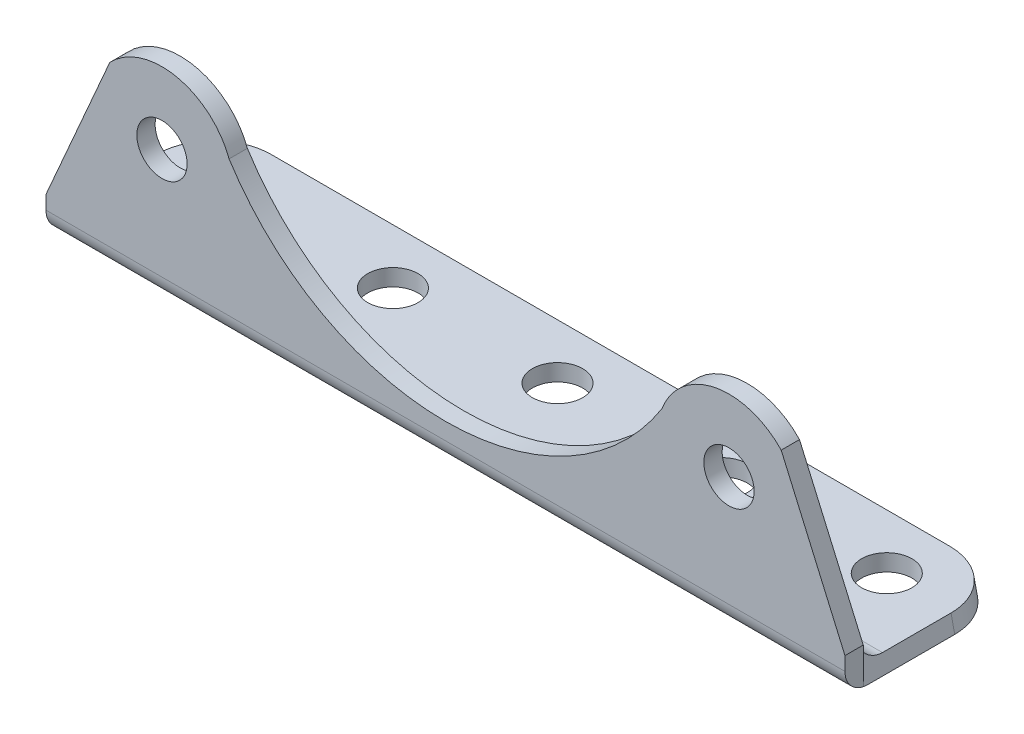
ISO-10303-21;
HEADER;
FILE_DESCRIPTION(('STEP AP214'),'2;1');
FILE_NAME('part.step','',(''),(''),'','','');
FILE_SCHEMA(('AUTOMOTIVE_DESIGN { 1 0 10303 214 1 1 1 1 }'));
ENDSEC;
DATA;
#1=APPLICATION_CONTEXT('core data for automotive mechanical design processes');
#2=APPLICATION_PROTOCOL_DEFINITION('international standard','automotive_design',2000,#1);
#3=PRODUCT_CONTEXT('',#1,'mechanical');
#4=PRODUCT('Part','Part','',(#3));
#5=PRODUCT_RELATED_PRODUCT_CATEGORY('part','',(#4));
#6=PRODUCT_DEFINITION_FORMATION('','',#4);
#7=PRODUCT_DEFINITION_CONTEXT('part definition',#1,'design');
#8=PRODUCT_DEFINITION('design','',#6,#7);
#9=PRODUCT_DEFINITION_SHAPE('','',#8);
#10=(LENGTH_UNIT() NAMED_UNIT(*) SI_UNIT(.MILLI.,.METRE.));
#11=(NAMED_UNIT(*) PLANE_ANGLE_UNIT() SI_UNIT($,.RADIAN.));
#12=(NAMED_UNIT(*) SI_UNIT($,.STERADIAN.) SOLID_ANGLE_UNIT());
#13=UNCERTAINTY_MEASURE_WITH_UNIT(LENGTH_MEASURE(1.E-05),#10,'distance_accuracy_value','');
#14=(GEOMETRIC_REPRESENTATION_CONTEXT(3) GLOBAL_UNCERTAINTY_ASSIGNED_CONTEXT((#13)) GLOBAL_UNIT_ASSIGNED_CONTEXT((#10,
#11,#12)) REPRESENTATION_CONTEXT('',''));
#15=CARTESIAN_POINT('',(0.,0.,0.));
#16=DIRECTION('',(0.,0.,1.));
#17=DIRECTION('',(1.,0.,0.));
#18=AXIS2_PLACEMENT_3D('',#15,#16,#17);
#19=CARTESIAN_POINT('',(-15.748,-9.0169870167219,0.));
#20=DIRECTION('',(0.,0.,-1.));
#21=DIRECTION('',(-1.,0.,0.));
#22=AXIS2_PLACEMENT_3D('',#19,#20,#21);
#23=PLANE('',#22);
#24=CARTESIAN_POINT('',(15.748,-9.01698701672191,0.));
#25=DIRECTION('',(0.,0.,1.));
#26=DIRECTION('',(-1.,0.,0.));
#27=AXIS2_PLACEMENT_3D('',#24,#25,#26);
#28=CIRCLE('',#27,1.397);
#29=CARTESIAN_POINT('',(14.351,-9.01698701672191,0.));
#30=VERTEX_POINT('',#29);
#31=EDGE_CURVE('E391',#30,#30,#28,.T.);
#32=ORIENTED_EDGE('',*,*,#31,.T.);
#33=EDGE_LOOP('',(#32));
#34=FACE_BOUND('',#33,.T.);
#35=DIRECTION('',(0.214370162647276,-0.976752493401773,0.));
#36=VECTOR('',#35,1.);
#37=CARTESIAN_POINT('',(21.9847480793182,-15.4939870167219,0.));
#38=LINE('',#37,#36);
#39=CARTESIAN_POINT('',(21.7060181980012,-14.2239870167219,0.));
#40=VERTEX_POINT('',#39);
#41=CARTESIAN_POINT('',(22.1838114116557,-16.4009957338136,0.));
#42=VERTEX_POINT('',#41);
#43=EDGE_CURVE('E45',#40,#42,#38,.T.);
#44=ORIENTED_EDGE('',*,*,#43,.F.);
#45=DIRECTION('',(1.,0.,0.));
#46=VECTOR('',#45,1.);
#47=CARTESIAN_POINT('',(-15.748,-14.2239870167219,0.));
#48=LINE('',#47,#46);
#49=CARTESIAN_POINT('',(0.0192184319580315,-14.2239870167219,0.));
#50=VERTEX_POINT('',#49);
#51=EDGE_CURVE('E451',#40,#50,#48,.F.);
#52=ORIENTED_EDGE('',*,*,#51,.T.);
#53=CARTESIAN_POINT('',(0.,0.,0.));
#54=DIRECTION('',(0.,0.,-1.));
#55=DIRECTION('',(1.,0.,0.));
#56=AXIS2_PLACEMENT_3D('',#53,#54,#55);
#57=CIRCLE('',#56,14.224);
#58=CARTESIAN_POINT('',(12.0193005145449,-7.6064834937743,0.));
#59=VERTEX_POINT('',#58);
#60=EDGE_CURVE('E159',#59,#50,#57,.T.);
#61=ORIENTED_EDGE('',*,*,#60,.F.);
#62=CARTESIAN_POINT('',(15.748,-9.01698701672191,0.));
#63=DIRECTION('',(0.,0.,1.));
#64=DIRECTION('',(1.,0.,0.));
#65=AXIS2_PLACEMENT_3D('',#62,#63,#64);
#66=CIRCLE('',#65,3.98656745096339);
#67=CARTESIAN_POINT('',(18.6476577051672,-6.28116808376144,0.));
#68=VERTEX_POINT('',#67);
#69=EDGE_CURVE('E153',#68,#59,#66,.T.);
#70=ORIENTED_EDGE('',*,*,#69,.F.);
#71=DIRECTION('',(-0.400072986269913,0.916483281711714,0.));
#72=VECTOR('',#71,1.);
#73=CARTESIAN_POINT('',(18.6476577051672,-6.28116808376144,0.));
#74=LINE('',#73,#72);
#75=CARTESIAN_POINT('',(22.1894428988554,-14.3946549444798,0.));
#76=VERTEX_POINT('',#75);
#77=EDGE_CURVE('E157',#76,#68,#74,.T.);
#78=ORIENTED_EDGE('',*,*,#77,.F.);
#79=DIRECTION('',(0.,1.,0.));
#80=VECTOR('',#79,1.);
#81=CARTESIAN_POINT('',(22.1894428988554,-16.4266549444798,0.));
#82=LINE('',#81,#80);
#83=CARTESIAN_POINT('',(22.1894428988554,-16.4009957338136,0.));
#84=VERTEX_POINT('',#83);
#85=EDGE_CURVE('E195',#84,#76,#82,.T.);
#86=ORIENTED_EDGE('',*,*,#85,.F.);
#87=DIRECTION('',(1.,0.,0.));
#88=VECTOR('',#87,1.);
#89=CARTESIAN_POINT('',(22.1894428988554,-16.4009957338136,0.));
#90=LINE('',#89,#88);
#91=EDGE_CURVE('E267',#84,#42,#90,.F.);
#92=ORIENTED_EDGE('',*,*,#91,.T.);
#93=EDGE_LOOP('',(#44,#52,#61,#70,#78,#86,#92));
#94=FACE_BOUND('',#93,.T.);
#95=ADVANCED_FACE('F29',(#34,#94),#23,.T.);
#96=CARTESIAN_POINT('',(-15.748,-9.0169870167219,1.016));
#97=DIRECTION('',(0.,0.,-1.));
#98=DIRECTION('',(-1.,0.,0.));
#99=AXIS2_PLACEMENT_3D('',#96,#97,#98);
#100=PLANE('',#99);
#101=CARTESIAN_POINT('',(-15.748,-9.0169870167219,1.016));
#102=DIRECTION('',(0.,0.,1.));
#103=DIRECTION('',(1.,0.,0.));
#104=AXIS2_PLACEMENT_3D('',#101,#102,#103);
#105=CIRCLE('',#104,1.397);
#106=CARTESIAN_POINT('',(-14.351,-9.0169870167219,1.016));
#107=VERTEX_POINT('',#106);
#108=EDGE_CURVE('E179',#107,#107,#105,.T.);
#109=ORIENTED_EDGE('',*,*,#108,.F.);
#110=EDGE_LOOP('',(#109));
#111=FACE_BOUND('',#110,.T.);
#112=DIRECTION('',(0.,-1.,0.));
#113=VECTOR('',#112,1.);
#114=CARTESIAN_POINT('',(-22.1894428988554,-16.4266549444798,1.016));
#115=LINE('',#114,#113);
#116=CARTESIAN_POINT('',(-22.1894428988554,-14.3946549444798,1.016));
#117=VERTEX_POINT('',#116);
#118=CARTESIAN_POINT('',(-22.1894428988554,-15.1566549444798,1.016));
#119=VERTEX_POINT('',#118);
#120=EDGE_CURVE('E206',#117,#119,#115,.T.);
#121=ORIENTED_EDGE('',*,*,#120,.T.);
#122=DIRECTION('',(1.,0.,0.));
#123=VECTOR('',#122,1.);
#124=CARTESIAN_POINT('',(-15.748,-15.1566549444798,1.016));
#125=LINE('',#124,#123);
#126=CARTESIAN_POINT('',(22.1894428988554,-15.1566549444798,1.016));
#127=VERTEX_POINT('',#126);
#128=EDGE_CURVE('E260',#119,#127,#125,.T.);
#129=ORIENTED_EDGE('',*,*,#128,.T.);
#130=DIRECTION('',(0.,1.,0.));
#131=VECTOR('',#130,1.);
#132=CARTESIAN_POINT('',(22.1894428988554,-16.4266549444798,1.016));
#133=LINE('',#132,#131);
#134=CARTESIAN_POINT('',(22.1894428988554,-14.3946549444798,1.016));
#135=VERTEX_POINT('',#134);
#136=EDGE_CURVE('E209',#127,#135,#133,.T.);
#137=ORIENTED_EDGE('',*,*,#136,.T.);
#138=DIRECTION('',(-0.400072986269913,0.916483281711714,0.));
#139=VECTOR('',#138,1.);
#140=CARTESIAN_POINT('',(18.6476577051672,-6.28116808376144,1.016));
#141=LINE('',#140,#139);
#142=CARTESIAN_POINT('',(18.6476577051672,-6.28116808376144,1.016));
#143=VERTEX_POINT('',#142);
#144=EDGE_CURVE('E197',#135,#143,#141,.T.);
#145=ORIENTED_EDGE('',*,*,#144,.T.);
#146=CARTESIAN_POINT('',(15.748,-9.01698701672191,1.016));
#147=DIRECTION('',(0.,0.,1.));
#148=DIRECTION('',(1.,0.,0.));
#149=AXIS2_PLACEMENT_3D('',#146,#147,#148);
#150=CIRCLE('',#149,3.98656745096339);
#151=CARTESIAN_POINT('',(12.0193005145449,-7.6064834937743,1.016));
#152=VERTEX_POINT('',#151);
#153=EDGE_CURVE('E168',#143,#152,#150,.T.);
#154=ORIENTED_EDGE('',*,*,#153,.T.);
#155=CARTESIAN_POINT('',(0.,0.,1.016));
#156=DIRECTION('',(0.,0.,-1.));
#157=DIRECTION('',(1.,0.,0.));
#158=AXIS2_PLACEMENT_3D('',#155,#156,#157);
#159=CIRCLE('',#158,14.224);
#160=CARTESIAN_POINT('',(-12.0193005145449,-7.60648349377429,1.016));
#161=VERTEX_POINT('',#160);
#162=EDGE_CURVE('E200',#152,#161,#159,.T.);
#163=ORIENTED_EDGE('',*,*,#162,.T.);
#164=CARTESIAN_POINT('',(-15.748,-9.0169870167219,1.016));
#165=DIRECTION('',(0.,0.,1.));
#166=DIRECTION('',(-1.,0.,0.));
#167=AXIS2_PLACEMENT_3D('',#164,#165,#166);
#168=CIRCLE('',#167,3.98656745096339);
#169=CARTESIAN_POINT('',(-18.6476577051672,-6.28116808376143,1.016));
#170=VERTEX_POINT('',#169);
#171=EDGE_CURVE('E202',#161,#170,#168,.T.);
#172=ORIENTED_EDGE('',*,*,#171,.T.);
#173=DIRECTION('',(-0.400072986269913,-0.916483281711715,0.));
#174=VECTOR('',#173,1.);
#175=CARTESIAN_POINT('',(-18.6476577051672,-6.28116808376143,1.016));
#176=LINE('',#175,#174);
#177=EDGE_CURVE('E204',#170,#117,#176,.T.);
#178=ORIENTED_EDGE('',*,*,#177,.T.);
#179=EDGE_LOOP('',(#121,#129,#137,#145,#154,#163,#172,#178));
#180=FACE_BOUND('',#179,.T.);
#181=CARTESIAN_POINT('',(15.748,-9.01698701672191,1.016));
#182=DIRECTION('',(0.,0.,1.));
#183=DIRECTION('',(-1.,0.,0.));
#184=AXIS2_PLACEMENT_3D('',#181,#182,#183);
#185=CIRCLE('',#184,1.397);
#186=CARTESIAN_POINT('',(14.351,-9.01698701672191,1.016));
#187=VERTEX_POINT('',#186);
#188=EDGE_CURVE('E389',#187,#187,#185,.T.);
#189=ORIENTED_EDGE('',*,*,#188,.F.);
#190=EDGE_LOOP('',(#189));
#191=FACE_BOUND('',#190,.T.);
#192=ADVANCED_FACE('F367',(#111,#180,#191),#100,.F.);
#193=CARTESIAN_POINT('',(-0.0192184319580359,-14.2239870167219,0.));
#194=VERTEX_POINT('',#193);
#195=CARTESIAN_POINT('',(-12.0193005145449,-7.60648349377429,0.));
#196=VERTEX_POINT('',#195);
#197=EDGE_CURVE('E163',#194,#196,#57,.T.);
#198=ORIENTED_EDGE('',*,*,#197,.F.);
#199=DIRECTION('',(1.,0.,0.));
#200=VECTOR('',#199,1.);
#201=CARTESIAN_POINT('',(-15.748,-14.2239870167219,0.));
#202=LINE('',#201,#200);
#203=CARTESIAN_POINT('',(-22.0662388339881,-14.2239870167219,0.));
#204=VERTEX_POINT('',#203);
#205=EDGE_CURVE('E447',#194,#204,#202,.F.);
#206=ORIENTED_EDGE('',*,*,#205,.T.);
#207=DIRECTION('',(0.055846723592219,0.99843935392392,0.));
#208=VECTOR('',#207,1.);
#209=CARTESIAN_POINT('',(-22.1372750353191,-15.4939870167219,0.));
#210=LINE('',#209,#208);
#211=CARTESIAN_POINT('',(-22.188007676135,-16.4009957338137,0.));
#212=VERTEX_POINT('',#211);
#213=EDGE_CURVE('E52',#212,#204,#210,.T.);
#214=ORIENTED_EDGE('',*,*,#213,.F.);
#215=DIRECTION('',(1.,0.,0.));
#216=VECTOR('',#215,1.);
#217=CARTESIAN_POINT('',(-22.188007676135,-16.4009957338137,0.));
#218=LINE('',#217,#216);
#219=CARTESIAN_POINT('',(-22.1894428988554,-16.4009957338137,0.));
#220=VERTEX_POINT('',#219);
#221=EDGE_CURVE('E265',#212,#220,#218,.F.);
#222=ORIENTED_EDGE('',*,*,#221,.T.);
#223=DIRECTION('',(0.,-1.,0.));
#224=VECTOR('',#223,1.);
#225=CARTESIAN_POINT('',(-22.1894428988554,-16.4266549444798,0.));
#226=LINE('',#225,#224);
#227=CARTESIAN_POINT('',(-22.1894428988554,-14.3946549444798,0.));
#228=VERTEX_POINT('',#227);
#229=EDGE_CURVE('E192',#228,#220,#226,.T.);
#230=ORIENTED_EDGE('',*,*,#229,.F.);
#231=DIRECTION('',(-0.400072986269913,-0.916483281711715,0.));
#232=VECTOR('',#231,1.);
#233=CARTESIAN_POINT('',(-18.6476577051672,-6.28116808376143,0.));
#234=LINE('',#233,#232);
#235=CARTESIAN_POINT('',(-18.6476577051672,-6.28116808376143,0.));
#236=VERTEX_POINT('',#235);
#237=EDGE_CURVE('E190',#236,#228,#234,.T.);
#238=ORIENTED_EDGE('',*,*,#237,.F.);
#239=CARTESIAN_POINT('',(-15.748,-9.0169870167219,0.));
#240=DIRECTION('',(0.,0.,1.));
#241=DIRECTION('',(-1.,0.,0.));
#242=AXIS2_PLACEMENT_3D('',#239,#240,#241);
#243=CIRCLE('',#242,3.98656745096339);
#244=EDGE_CURVE('E187',#196,#236,#243,.T.);
#245=ORIENTED_EDGE('',*,*,#244,.F.);
#246=EDGE_LOOP('',(#198,#206,#214,#222,#230,#238,#245));
#247=FACE_BOUND('',#246,.T.);
#248=CARTESIAN_POINT('',(-15.748,-9.0169870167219,0.));
#249=DIRECTION('',(0.,0.,1.));
#250=DIRECTION('',(1.,0.,0.));
#251=AXIS2_PLACEMENT_3D('',#248,#249,#250);
#252=CIRCLE('',#251,1.397);
#253=CARTESIAN_POINT('',(-14.351,-9.0169870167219,0.));
#254=VERTEX_POINT('',#253);
#255=EDGE_CURVE('E182',#254,#254,#252,.T.);
#256=ORIENTED_EDGE('',*,*,#255,.T.);
#257=EDGE_LOOP('',(#256));
#258=FACE_BOUND('',#257,.T.);
#259=ADVANCED_FACE('F369',(#247,#258),#23,.T.);
#260=CARTESIAN_POINT('',(18.6476577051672,-6.28116808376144,1.016));
#261=DIRECTION('',(-0.916483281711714,-0.400072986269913,0.));
#262=DIRECTION('',(0.400072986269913,-0.916483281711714,0.));
#263=AXIS2_PLACEMENT_3D('',#260,#261,#262);
#264=PLANE('',#263);
#265=ORIENTED_EDGE('',*,*,#77,.T.);
#266=DIRECTION('',(0.,0.,-1.));
#267=VECTOR('',#266,1.);
#268=CARTESIAN_POINT('',(18.6476577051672,-6.28116808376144,1.016));
#269=LINE('',#268,#267);
#270=EDGE_CURVE('E166',#143,#68,#269,.T.);
#271=ORIENTED_EDGE('',*,*,#270,.F.);
#272=ORIENTED_EDGE('',*,*,#144,.F.);
#273=DIRECTION('',(0.,0.,-1.));
#274=VECTOR('',#273,1.);
#275=CARTESIAN_POINT('',(22.1894428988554,-14.3946549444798,1.016));
#276=LINE('',#275,#274);
#277=EDGE_CURVE('E178',#135,#76,#276,.T.);
#278=ORIENTED_EDGE('',*,*,#277,.T.);
#279=EDGE_LOOP('',(#265,#271,#272,#278));
#280=FACE_BOUND('',#279,.T.);
#281=ADVANCED_FACE('F176',(#280),#264,.F.);
#282=CARTESIAN_POINT('',(15.748,-9.01698701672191,1.016));
#283=DIRECTION('',(0.,0.,-1.));
#284=DIRECTION('',(-1.,0.,0.));
#285=AXIS2_PLACEMENT_3D('',#282,#283,#284);
#286=CYLINDRICAL_SURFACE('',#285,3.98656745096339);
#287=ORIENTED_EDGE('',*,*,#69,.T.);
#288=DIRECTION('',(0.,0.,-1.));
#289=VECTOR('',#288,1.);
#290=CARTESIAN_POINT('',(12.0193005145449,-7.6064834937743,1.016));
#291=LINE('',#290,#289);
#292=EDGE_CURVE('E173',#152,#59,#291,.T.);
#293=ORIENTED_EDGE('',*,*,#292,.F.);
#294=ORIENTED_EDGE('',*,*,#153,.F.);
#295=ORIENTED_EDGE('',*,*,#270,.T.);
#296=EDGE_LOOP('',(#287,#293,#294,#295));
#297=FACE_BOUND('',#296,.T.);
#298=ADVANCED_FACE('F167',(#297),#286,.T.);
#299=CARTESIAN_POINT('',(0.,0.,1.016));
#300=DIRECTION('',(0.,0.,-1.));
#301=DIRECTION('',(-1.,0.,0.));
#302=AXIS2_PLACEMENT_3D('',#299,#300,#301);
#303=CYLINDRICAL_SURFACE('',#302,14.224);
#304=ORIENTED_EDGE('',*,*,#60,.T.);
#305=EDGE_CURVE('E188',#50,#194,#57,.T.);
#306=ORIENTED_EDGE('',*,*,#305,.T.);
#307=ORIENTED_EDGE('',*,*,#197,.T.);
#308=DIRECTION('',(0.,0.,-1.));
#309=VECTOR('',#308,1.);
#310=CARTESIAN_POINT('',(-12.0193005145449,-7.60648349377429,1.016));
#311=LINE('',#310,#309);
#312=EDGE_CURVE('E218',#161,#196,#311,.T.);
#313=ORIENTED_EDGE('',*,*,#312,.F.);
#314=ORIENTED_EDGE('',*,*,#162,.F.);
#315=ORIENTED_EDGE('',*,*,#292,.T.);
#316=EDGE_LOOP('',(#304,#306,#307,#313,#314,#315));
#317=FACE_BOUND('',#316,.T.);
#318=ADVANCED_FACE('F490',(#317),#303,.F.);
#319=CARTESIAN_POINT('',(-15.748,-9.0169870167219,1.016));
#320=DIRECTION('',(0.,0.,-1.));
#321=DIRECTION('',(-1.,0.,0.));
#322=AXIS2_PLACEMENT_3D('',#319,#320,#321);
#323=CYLINDRICAL_SURFACE('',#322,3.98656745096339);
#324=ORIENTED_EDGE('',*,*,#244,.T.);
#325=DIRECTION('',(0.,0.,-1.));
#326=VECTOR('',#325,1.);
#327=CARTESIAN_POINT('',(-18.6476577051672,-6.28116808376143,1.016));
#328=LINE('',#327,#326);
#329=EDGE_CURVE('E215',#170,#236,#328,.T.);
#330=ORIENTED_EDGE('',*,*,#329,.F.);
#331=ORIENTED_EDGE('',*,*,#171,.F.);
#332=ORIENTED_EDGE('',*,*,#312,.T.);
#333=EDGE_LOOP('',(#324,#330,#331,#332));
#334=FACE_BOUND('',#333,.T.);
#335=ADVANCED_FACE('F494',(#334),#323,.T.);
#336=CARTESIAN_POINT('',(-18.6476577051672,-6.28116808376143,1.016));
#337=DIRECTION('',(0.916483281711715,-0.400072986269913,0.));
#338=DIRECTION('',(0.400072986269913,0.916483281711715,0.));
#339=AXIS2_PLACEMENT_3D('',#336,#337,#338);
#340=PLANE('',#339);
#341=ORIENTED_EDGE('',*,*,#237,.T.);
#342=DIRECTION('',(0.,0.,-1.));
#343=VECTOR('',#342,1.);
#344=CARTESIAN_POINT('',(-22.1894428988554,-14.3946549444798,1.016));
#345=LINE('',#344,#343);
#346=EDGE_CURVE('E212',#117,#228,#345,.T.);
#347=ORIENTED_EDGE('',*,*,#346,.F.);
#348=ORIENTED_EDGE('',*,*,#177,.F.);
#349=ORIENTED_EDGE('',*,*,#329,.T.);
#350=EDGE_LOOP('',(#341,#347,#348,#349));
#351=FACE_BOUND('',#350,.T.);
#352=ADVANCED_FACE('F499',(#351),#340,.F.);
#353=CARTESIAN_POINT('',(-22.1894428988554,-16.4266549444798,1.016));
#354=DIRECTION('',(1.,0.,0.));
#355=DIRECTION('',(0.,0.,-1.));
#356=AXIS2_PLACEMENT_3D('',#353,#354,#355);
#357=PLANE('',#356);
#358=ORIENTED_EDGE('',*,*,#229,.T.);
#359=CARTESIAN_POINT('',(-22.1894428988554,-15.1566549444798,-0.254));
#360=DIRECTION('',(1.,0.,0.));
#361=DIRECTION('',(0.,0.,-1.));
#362=AXIS2_PLACEMENT_3D('',#359,#360,#361);
#363=CIRCLE('',#362,1.27);
#364=EDGE_CURVE('E275',#220,#119,#363,.F.);
#365=ORIENTED_EDGE('',*,*,#364,.T.);
#366=ORIENTED_EDGE('',*,*,#120,.F.);
#367=ORIENTED_EDGE('',*,*,#346,.T.);
#368=EDGE_LOOP('',(#358,#365,#366,#367));
#369=FACE_BOUND('',#368,.T.);
#370=ADVANCED_FACE('F426',(#369),#357,.F.);
#371=CARTESIAN_POINT('',(22.1894428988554,-16.4266549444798,1.016));
#372=DIRECTION('',(0.,1.,0.));
#373=DIRECTION('',(-1.,0.,0.));
#374=AXIS2_PLACEMENT_3D('',#371,#372,#373);
#375=PLANE('',#374);
#376=CARTESIAN_POINT('',(-18.288,-16.4266549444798,-5.20700000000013));
#377=DIRECTION('',(0.,-1.,0.));
#378=DIRECTION('',(1.,0.,0.));
#379=AXIS2_PLACEMENT_3D('',#376,#377,#378);
#380=CIRCLE('',#379,1.397);
#381=CARTESIAN_POINT('',(-16.891,-16.4266549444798,-5.20700000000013));
#382=VERTEX_POINT('',#381);
#383=EDGE_CURVE('E241',#382,#382,#380,.T.);
#384=ORIENTED_EDGE('',*,*,#383,.F.);
#385=EDGE_LOOP('',(#384));
#386=FACE_BOUND('',#385,.T.);
#387=CARTESIAN_POINT('',(-9.144,-16.4266549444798,-5.20700000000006));
#388=DIRECTION('',(0.,-1.,0.));
#389=DIRECTION('',(1.,0.,0.));
#390=AXIS2_PLACEMENT_3D('',#387,#388,#389);
#391=CIRCLE('',#390,1.397);
#392=CARTESIAN_POINT('',(-7.747,-16.4266549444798,-5.20700000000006));
#393=VERTEX_POINT('',#392);
#394=EDGE_CURVE('E237',#393,#393,#391,.T.);
#395=ORIENTED_EDGE('',*,*,#394,.F.);
#396=EDGE_LOOP('',(#395));
#397=FACE_BOUND('',#396,.T.);
#398=CARTESIAN_POINT('',(18.288,-16.4266549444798,-5.207));
#399=DIRECTION('',(0.,-1.,0.));
#400=DIRECTION('',(1.,0.,0.));
#401=AXIS2_PLACEMENT_3D('',#398,#399,#400);
#402=CIRCLE('',#401,1.397);
#403=CARTESIAN_POINT('',(19.685,-16.4266549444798,-5.207));
#404=VERTEX_POINT('',#403);
#405=EDGE_CURVE('E233',#404,#404,#402,.T.);
#406=ORIENTED_EDGE('',*,*,#405,.F.);
#407=EDGE_LOOP('',(#406));
#408=FACE_BOUND('',#407,.T.);
#409=CARTESIAN_POINT('',(9.144,-16.4266549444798,-5.207));
#410=DIRECTION('',(0.,-1.,0.));
#411=DIRECTION('',(1.,0.,0.));
#412=AXIS2_PLACEMENT_3D('',#409,#410,#411);
#413=CIRCLE('',#412,1.397);
#414=CARTESIAN_POINT('',(10.541,-16.4266549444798,-5.207));
#415=VERTEX_POINT('',#414);
#416=EDGE_CURVE('E229',#415,#415,#413,.T.);
#417=ORIENTED_EDGE('',*,*,#416,.F.);
#418=EDGE_LOOP('',(#417));
#419=FACE_BOUND('',#418,.T.);
#420=CARTESIAN_POINT('',(0.,-16.4266549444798,-5.207));
#421=DIRECTION('',(0.,-1.,0.));
#422=DIRECTION('',(1.,0.,0.));
#423=AXIS2_PLACEMENT_3D('',#420,#421,#422);
#424=CIRCLE('',#423,1.397);
#425=CARTESIAN_POINT('',(1.397,-16.4266549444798,-5.207));
#426=VERTEX_POINT('',#425);
#427=EDGE_CURVE('E225',#426,#426,#424,.T.);
#428=ORIENTED_EDGE('',*,*,#427,.F.);
#429=EDGE_LOOP('',(#428));
#430=FACE_BOUND('',#429,.T.);
#431=DIRECTION('',(0.,0.,1.));
#432=VECTOR('',#431,1.);
#433=CARTESIAN_POINT('',(22.1894428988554,-16.4266549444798,-8.255));
#434=LINE('',#433,#432);
#435=CARTESIAN_POINT('',(22.1894428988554,-16.4266549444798,-5.08));
#436=VERTEX_POINT('',#435);
#437=CARTESIAN_POINT('',(22.1894428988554,-16.4266549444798,-0.254000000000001));
#438=VERTEX_POINT('',#437);
#439=EDGE_CURVE('E401',#436,#438,#434,.T.);
#440=ORIENTED_EDGE('',*,*,#439,.T.);
#441=DIRECTION('',(1.,0.,0.));
#442=VECTOR('',#441,1.);
#443=CARTESIAN_POINT('',(22.1894428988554,-16.4266549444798,-0.254));
#444=LINE('',#443,#442);
#445=CARTESIAN_POINT('',(-22.1894428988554,-16.4266549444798,-0.254000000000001));
#446=VERTEX_POINT('',#445);
#447=EDGE_CURVE('E271',#438,#446,#444,.F.);
#448=ORIENTED_EDGE('',*,*,#447,.T.);
#449=DIRECTION('',(0.,0.,1.));
#450=VECTOR('',#449,1.);
#451=CARTESIAN_POINT('',(-22.1894428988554,-16.4266549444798,-8.255));
#452=LINE('',#451,#450);
#453=CARTESIAN_POINT('',(-22.1894428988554,-16.4266549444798,-5.08));
#454=VERTEX_POINT('',#453);
#455=EDGE_CURVE('E404',#454,#446,#452,.T.);
#456=ORIENTED_EDGE('',*,*,#455,.F.);
#457=CARTESIAN_POINT('',(-19.009480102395,-16.4266549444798,-5.08));
#458=DIRECTION('',(0.,1.,0.));
#459=DIRECTION('',(1.,0.,0.));
#460=AXIS2_PLACEMENT_3D('',#457,#458,#459);
#461=ELLIPSE('',#460,3.17996279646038,3.175);
#462=CARTESIAN_POINT('',(-19.009480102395,-16.4266549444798,-8.255));
#463=VERTEX_POINT('',#462);
#464=EDGE_CURVE('E258',#454,#463,#461,.F.);
#465=ORIENTED_EDGE('',*,*,#464,.T.);
#466=DIRECTION('',(-1.,0.,0.));
#467=VECTOR('',#466,1.);
#468=CARTESIAN_POINT('',(22.1894428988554,-16.4266549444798,-8.255));
#469=LINE('',#468,#467);
#470=CARTESIAN_POINT('',(18.9388753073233,-16.4266549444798,-8.255));
#471=VERTEX_POINT('',#470);
#472=EDGE_CURVE('E407',#471,#463,#469,.T.);
#473=ORIENTED_EDGE('',*,*,#472,.F.);
#474=CARTESIAN_POINT('',(18.9388753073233,-16.4266549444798,-5.08));
#475=DIRECTION('',(0.,1.,0.));
#476=DIRECTION('',(1.,0.,0.));
#477=AXIS2_PLACEMENT_3D('',#474,#475,#476);
#478=ELLIPSE('',#477,3.25056759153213,3.175);
#479=EDGE_CURVE('E244',#471,#436,#478,.F.);
#480=ORIENTED_EDGE('',*,*,#479,.T.);
#481=EDGE_LOOP('',(#440,#448,#456,#465,#473,#480));
#482=FACE_BOUND('',#481,.T.);
#483=ADVANCED_FACE('F422',(#386,#397,#408,#419,#430,#482),#375,.F.);
#484=CARTESIAN_POINT('',(22.1894428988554,-16.4266549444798,1.016));
#485=DIRECTION('',(-1.,0.,0.));
#486=DIRECTION('',(0.,0.,1.));
#487=AXIS2_PLACEMENT_3D('',#484,#485,#486);
#488=PLANE('',#487);
#489=ORIENTED_EDGE('',*,*,#136,.F.);
#490=CARTESIAN_POINT('',(22.1894428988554,-15.1566549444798,-0.254));
#491=DIRECTION('',(-1.,0.,0.));
#492=DIRECTION('',(0.,0.,1.));
#493=AXIS2_PLACEMENT_3D('',#490,#491,#492);
#494=CIRCLE('',#493,1.27);
#495=EDGE_CURVE('E263',#127,#84,#494,.F.);
#496=ORIENTED_EDGE('',*,*,#495,.T.);
#497=ORIENTED_EDGE('',*,*,#85,.T.);
#498=ORIENTED_EDGE('',*,*,#277,.F.);
#499=EDGE_LOOP('',(#489,#496,#497,#498));
#500=FACE_BOUND('',#499,.T.);
#501=ADVANCED_FACE('F425',(#500),#488,.F.);
#502=CARTESIAN_POINT('',(-15.748,-9.0169870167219,1.016));
#503=DIRECTION('',(0.,0.,-1.));
#504=DIRECTION('',(-1.,0.,0.));
#505=AXIS2_PLACEMENT_3D('',#502,#503,#504);
#506=CYLINDRICAL_SURFACE('',#505,1.397);
#507=ORIENTED_EDGE('',*,*,#108,.T.);
#508=EDGE_LOOP('',(#507));
#509=FACE_BOUND('',#508,.T.);
#510=ORIENTED_EDGE('',*,*,#255,.F.);
#511=EDGE_LOOP('',(#510));
#512=FACE_BOUND('',#511,.T.);
#513=ADVANCED_FACE('F510',(#509,#512),#506,.F.);
#514=CARTESIAN_POINT('',(15.748,-9.01698701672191,1.016));
#515=DIRECTION('',(0.,0.,-1.));
#516=DIRECTION('',(-1.,0.,0.));
#517=AXIS2_PLACEMENT_3D('',#514,#515,#516);
#518=CYLINDRICAL_SURFACE('',#517,1.397);
#519=ORIENTED_EDGE('',*,*,#188,.T.);
#520=EDGE_LOOP('',(#519));
#521=FACE_BOUND('',#520,.T.);
#522=ORIENTED_EDGE('',*,*,#31,.F.);
#523=EDGE_LOOP('',(#522));
#524=FACE_BOUND('',#523,.T.);
#525=ADVANCED_FACE('F515',(#521,#524),#518,.F.);
#526=CARTESIAN_POINT('',(-22.1372750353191,-15.4939870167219,-8.255));
#527=DIRECTION('',(0.99843935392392,-0.055846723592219,0.));
#528=DIRECTION('',(0.055846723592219,0.99843935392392,0.));
#529=AXIS2_PLACEMENT_3D('',#526,#527,#528);
#530=PLANE('',#529);
#531=ORIENTED_EDGE('',*,*,#455,.T.);
#532=CARTESIAN_POINT('',(-22.1184066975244,-15.1566549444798,-0.254));
#533=DIRECTION('',(0.99843935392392,-0.055846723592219,0.));
#534=DIRECTION('',(0.055846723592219,0.99843935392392,0.));
#535=AXIS2_PLACEMENT_3D('',#532,#533,#534);
#536=ELLIPSE('',#535,1.27198511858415,1.27);
#537=EDGE_CURVE('E273',#446,#212,#536,.F.);
#538=ORIENTED_EDGE('',*,*,#537,.T.);
#539=ORIENTED_EDGE('',*,*,#213,.T.);
#540=CARTESIAN_POINT('',(-22.0662388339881,-14.2239870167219,-1.27));
#541=DIRECTION('',(0.99843935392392,-0.055846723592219,0.));
#542=DIRECTION('',(0.055846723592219,0.99843935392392,0.));
#543=AXIS2_PLACEMENT_3D('',#540,#541,#542);
#544=ELLIPSE('',#543,1.27198511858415,1.27);
#545=CARTESIAN_POINT('',(-22.1372750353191,-15.4939870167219,-1.27));
#546=VERTEX_POINT('',#545);
#547=EDGE_CURVE('E11',#204,#546,#544,.T.);
#548=ORIENTED_EDGE('',*,*,#547,.T.);
#549=DIRECTION('',(0.,0.,1.));
#550=VECTOR('',#549,1.);
#551=CARTESIAN_POINT('',(-22.1372750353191,-15.4939870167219,-8.255));
#552=LINE('',#551,#550);
#553=CARTESIAN_POINT('',(-22.1372750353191,-15.4939870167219,-5.08));
#554=VERTEX_POINT('',#553);
#555=EDGE_CURVE('E395',#554,#546,#552,.T.);
#556=ORIENTED_EDGE('',*,*,#555,.F.);
#557=DIRECTION('',(0.055846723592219,0.99843935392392,0.));
#558=VECTOR('',#557,1.);
#559=CARTESIAN_POINT('',(-22.1372750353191,-15.4939870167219,-5.08));
#560=LINE('',#559,#558);
#561=EDGE_CURVE('E256',#554,#454,#560,.F.);
#562=ORIENTED_EDGE('',*,*,#561,.T.);
#563=EDGE_LOOP('',(#531,#538,#539,#548,#556,#562));
#564=FACE_BOUND('',#563,.T.);
#565=ADVANCED_FACE('F293',(#564),#530,.F.);
#566=CARTESIAN_POINT('',(-22.1372750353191,-15.4939870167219,-8.255));
#567=DIRECTION('',(0.,-1.,0.));
#568=DIRECTION('',(1.,0.,0.));
#569=AXIS2_PLACEMENT_3D('',#566,#567,#568);
#570=PLANE('',#569);
#571=CARTESIAN_POINT('',(-18.288,-15.4939870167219,-5.20700000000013));
#572=DIRECTION('',(0.,-1.,0.));
#573=DIRECTION('',(1.,0.,0.));
#574=AXIS2_PLACEMENT_3D('',#571,#572,#573);
#575=CIRCLE('',#574,1.397);
#576=CARTESIAN_POINT('',(-16.891,-15.4939870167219,-5.20700000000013));
#577=VERTEX_POINT('',#576);
#578=EDGE_CURVE('E238',#577,#577,#575,.T.);
#579=ORIENTED_EDGE('',*,*,#578,.T.);
#580=EDGE_LOOP('',(#579));
#581=FACE_BOUND('',#580,.T.);
#582=CARTESIAN_POINT('',(-9.144,-15.4939870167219,-5.20700000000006));
#583=DIRECTION('',(0.,-1.,0.));
#584=DIRECTION('',(1.,0.,0.));
#585=AXIS2_PLACEMENT_3D('',#582,#583,#584);
#586=CIRCLE('',#585,1.397);
#587=CARTESIAN_POINT('',(-7.747,-15.4939870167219,-5.20700000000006));
#588=VERTEX_POINT('',#587);
#589=EDGE_CURVE('E234',#588,#588,#586,.T.);
#590=ORIENTED_EDGE('',*,*,#589,.T.);
#591=EDGE_LOOP('',(#590));
#592=FACE_BOUND('',#591,.T.);
#593=CARTESIAN_POINT('',(18.288,-15.4939870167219,-5.207));
#594=DIRECTION('',(0.,-1.,0.));
#595=DIRECTION('',(1.,0.,0.));
#596=AXIS2_PLACEMENT_3D('',#593,#594,#595);
#597=CIRCLE('',#596,1.397);
#598=CARTESIAN_POINT('',(19.685,-15.4939870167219,-5.207));
#599=VERTEX_POINT('',#598);
#600=EDGE_CURVE('E230',#599,#599,#597,.T.);
#601=ORIENTED_EDGE('',*,*,#600,.T.);
#602=EDGE_LOOP('',(#601));
#603=FACE_BOUND('',#602,.T.);
#604=CARTESIAN_POINT('',(9.144,-15.4939870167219,-5.207));
#605=DIRECTION('',(0.,-1.,0.));
#606=DIRECTION('',(1.,0.,0.));
#607=AXIS2_PLACEMENT_3D('',#604,#605,#606);
#608=CIRCLE('',#607,1.397);
#609=CARTESIAN_POINT('',(10.541,-15.4939870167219,-5.207));
#610=VERTEX_POINT('',#609);
#611=EDGE_CURVE('E226',#610,#610,#608,.T.);
#612=ORIENTED_EDGE('',*,*,#611,.T.);
#613=EDGE_LOOP('',(#612));
#614=FACE_BOUND('',#613,.T.);
#615=CARTESIAN_POINT('',(0.,-15.4939870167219,-5.207));
#616=DIRECTION('',(0.,-1.,0.));
#617=DIRECTION('',(1.,0.,0.));
#618=AXIS2_PLACEMENT_3D('',#615,#616,#617);
#619=CIRCLE('',#618,1.397);
#620=CARTESIAN_POINT('',(1.397,-15.4939870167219,-5.207));
#621=VERTEX_POINT('',#620);
#622=EDGE_CURVE('E222',#621,#621,#619,.T.);
#623=ORIENTED_EDGE('',*,*,#622,.T.);
#624=EDGE_LOOP('',(#623));
#625=FACE_BOUND('',#624,.T.);
#626=ORIENTED_EDGE('',*,*,#555,.T.);
#627=DIRECTION('',(1.,0.,0.));
#628=VECTOR('',#627,1.);
#629=CARTESIAN_POINT('',(-22.1372750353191,-15.4939870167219,-1.27));
#630=LINE('',#629,#628);
#631=CARTESIAN_POINT('',(-0.0192184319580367,-15.4939870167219,-1.27));
#632=VERTEX_POINT('',#631);
#633=EDGE_CURVE('E285',#546,#632,#630,.T.);
#634=ORIENTED_EDGE('',*,*,#633,.T.);
#635=CARTESIAN_POINT('',(-6.14347046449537,-15.4939870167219,0.));
#636=CARTESIAN_POINT('',(-5.10915888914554,-15.4939870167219,0.));
#637=CARTESIAN_POINT('',(-4.89976757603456,-14.4810922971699,0.));
#638=CARTESIAN_POINT('',(-4.69037626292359,-13.4681975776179,0.));
#639=CARTESIAN_POINT('',(-5.63990734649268,-13.0580864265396,0.));
#640=CARTESIAN_POINT('',(-6.14347733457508,-15.4939870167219,-0.0155934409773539));
#641=CARTESIAN_POINT('',(-5.10911704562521,-15.4939870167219,0.0164573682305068));
#642=CARTESIAN_POINT('',(-4.89972307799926,-14.4810873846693,0.022943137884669));
#643=CARTESIAN_POINT('',(-4.69033135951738,-13.4681884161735,0.0294259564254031));
#644=CARTESIAN_POINT('',(-5.63991245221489,-13.0580840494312,0.));
#645=CARTESIAN_POINT('',(-6.14274643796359,-15.4939870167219,-0.0311832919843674));
#646=CARTESIAN_POINT('',(-5.11017585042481,-15.4939870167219,0.0328680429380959));
#647=CARTESIAN_POINT('',(-4.90089375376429,-14.4813910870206,0.0458382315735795));
#648=CARTESIAN_POINT('',(-4.69161137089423,-13.4687951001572,0.0587988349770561));
#649=CARTESIAN_POINT('',(-5.63934713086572,-13.0583283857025,0.));
#650=CARTESIAN_POINT('',(-6.13986175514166,-15.4939870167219,-0.0622136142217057));
#651=CARTESIAN_POINT('',(-5.11417243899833,-15.4939870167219,0.0647896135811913));
#652=CARTESIAN_POINT('',(-4.90532458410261,-14.4825782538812,0.0906391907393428));
#653=CARTESIAN_POINT('',(-4.69647529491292,-13.4711690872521,0.116480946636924));
#654=CARTESIAN_POINT('',(-5.63711496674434,-13.0592922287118,0.));
#655=CARTESIAN_POINT('',(-6.13770957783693,-15.4939870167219,-0.0776542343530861));
#656=CARTESIAN_POINT('',(-5.11710661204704,-15.4939870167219,0.080295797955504));
#657=CARTESIAN_POINT('',(-4.90858237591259,-14.4834610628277,0.11254614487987));
#658=CARTESIAN_POINT('',(-4.7000547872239,-13.4729341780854,0.144780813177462));
#659=CARTESIAN_POINT('',(-5.63544936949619,-13.0600111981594,0.));
#660=CARTESIAN_POINT('',(-6.13206733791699,-15.4939870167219,-0.10810389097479));
#661=CARTESIAN_POINT('',(-5.12448457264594,-15.4939870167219,0.109467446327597));
#662=CARTESIAN_POINT('',(-4.91680054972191,-14.4857558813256,0.154292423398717));
#663=CARTESIAN_POINT('',(-4.70911371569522,-13.477523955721,0.199101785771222));
#664=CARTESIAN_POINT('',(-5.63108104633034,-13.0618952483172,0.));
#665=CARTESIAN_POINT('',(-6.1285929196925,-15.4939870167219,-0.123115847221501));
#666=CARTESIAN_POINT('',(-5.12890820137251,-15.4939870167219,0.123148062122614));
#667=CARTESIAN_POINT('',(-4.92174095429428,-14.487161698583,0.174152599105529));
#668=CARTESIAN_POINT('',(-4.71456783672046,-13.4803346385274,0.225137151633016));
#669=CARTESIAN_POINT('',(-5.62839044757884,-13.0630551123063,0.));
#670=CARTESIAN_POINT('',(-6.12039204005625,-15.4939870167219,-0.152796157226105));
#671=CARTESIAN_POINT('',(-5.13876114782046,-15.4939870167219,0.148383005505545));
#672=CARTESIAN_POINT('',(-4.93279944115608,-14.4904420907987,0.211545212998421));
#673=CARTESIAN_POINT('',(-4.72683178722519,-13.486895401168,0.274687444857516));
#674=CARTESIAN_POINT('',(-5.62203617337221,-13.065791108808,0.));
#675=CARTESIAN_POINT('',(-6.11566517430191,-15.4939870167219,-0.167464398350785));
#676=CARTESIAN_POINT('',(-5.14418822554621,-15.4939870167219,0.159935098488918));
#677=CARTESIAN_POINT('',(-4.93891790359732,-14.4923168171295,0.229076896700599));
#678=CARTESIAN_POINT('',(-4.73363875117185,-13.4906437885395,0.298196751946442));
#679=CARTESIAN_POINT('',(-5.61837218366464,-13.0673673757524,0.));
#680=CARTESIAN_POINT('',(-6.10384685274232,-15.4939870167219,-0.199692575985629));
#681=CARTESIAN_POINT('',(-5.15680520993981,-15.4939870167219,0.183018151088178));
#682=CARTESIAN_POINT('',(-4.9532433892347,-14.4969404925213,0.265223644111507));
#683=CARTESIAN_POINT('',(-4.74966871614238,-13.4998897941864,0.347396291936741));
#684=CARTESIAN_POINT('',(-5.60920508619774,-13.0713053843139,0.));
#685=CARTESIAN_POINT('',(-6.09646176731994,-15.4939870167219,-0.217145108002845));
#686=CARTESIAN_POINT('',(-5.16411301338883,-15.4939870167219,0.193943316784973));
#687=CARTESIAN_POINT('',(-4.96160776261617,-14.4997913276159,0.283166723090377));
#688=CARTESIAN_POINT('',(-4.75908613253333,-13.5055895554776,0.372358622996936));
#689=CARTESIAN_POINT('',(-5.60347294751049,-13.0737643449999,0.));
#690=CARTESIAN_POINT('',(-6.08016658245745,-15.4939870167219,-0.251317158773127));
#691=CARTESIAN_POINT('',(-5.17854635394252,-15.4939870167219,0.212156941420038));
#692=CARTESIAN_POINT('',(-4.9783334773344,-14.5059612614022,0.31500771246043));
#693=CARTESIAN_POINT('',(-4.77810366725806,-13.5179293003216,0.417826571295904));
#694=CARTESIAN_POINT('',(-5.59081201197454,-13.0791836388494,0.));
#695=CARTESIAN_POINT('',(-6.07125615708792,-15.4939870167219,-0.268036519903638));
#696=CARTESIAN_POINT('',(-5.18567008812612,-15.4939870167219,0.219449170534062));
#697=CARTESIAN_POINT('',(-4.98669481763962,-14.5092804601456,0.32890475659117));
#698=CARTESIAN_POINT('',(-4.78770065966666,-13.5245657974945,0.438333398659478));
#699=CARTESIAN_POINT('',(-5.58388295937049,-13.0821440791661,0.));
#700=CARTESIAN_POINT('',(-6.04246517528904,-15.4939870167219,-0.317164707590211));
#701=CARTESIAN_POINT('',(-5.20571867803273,-15.4939870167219,0.236347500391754));
#702=CARTESIAN_POINT('',(-5.01069309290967,-14.5197805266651,0.365054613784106));
#703=CARTESIAN_POINT('',(-4.81559763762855,-13.5455431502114,0.49365346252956));
#704=CARTESIAN_POINT('',(-5.56146751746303,-13.0916965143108,0.));
#705=CARTESIAN_POINT('',(-6.02057678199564,-15.4939870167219,-0.348409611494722));
#706=CARTESIAN_POINT('',(-5.21730647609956,-15.4939870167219,0.240959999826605));
#707=CARTESIAN_POINT('',(-5.02517297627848,-14.5274828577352,0.381619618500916));
#708=CARTESIAN_POINT('',(-4.83298427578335,-13.5609387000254,0.522224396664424));
#709=CARTESIAN_POINT('',(-5.54439297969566,-13.0989422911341,0.));
#710=CARTESIAN_POINT('',(-5.97788741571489,-15.4939870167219,-0.401598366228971));
#711=CARTESIAN_POINT('',(-5.23239743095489,-15.4939870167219,0.24072824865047));
#712=CARTESIAN_POINT('',(-5.0457053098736,-14.54183808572,0.4013679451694));
#713=CARTESIAN_POINT('',(-4.85897449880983,-13.5896632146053,0.561971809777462));
#714=CARTESIAN_POINT('',(-5.5109932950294,-13.1130235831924,0.));
#715=CARTESIAN_POINT('',(-5.95779399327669,-15.4939870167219,-0.424131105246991));
#716=CARTESIAN_POINT('',(-5.23708557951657,-15.4939870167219,0.23766595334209));
#717=CARTESIAN_POINT('',(-5.05288017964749,-14.5483795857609,0.406607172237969));
#718=CARTESIAN_POINT('',(-4.86865305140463,-13.6027446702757,0.575536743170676));
#719=CARTESIAN_POINT('',(-5.49524049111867,-13.1196352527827,0.));
#720=CARTESIAN_POINT('',(-5.9157114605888,-15.4939870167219,-0.467373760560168));
#721=CARTESIAN_POINT('',(-5.24235374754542,-15.4939870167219,0.22748051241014));
#722=CARTESIAN_POINT('',(-5.06322343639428,-14.5616201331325,0.412110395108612));
#723=CARTESIAN_POINT('',(-4.88407208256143,-13.6292259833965,0.596729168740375));
#724=CARTESIAN_POINT('',(-5.46216641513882,-13.1334395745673,0.));
#725=CARTESIAN_POINT('',(-5.89372115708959,-15.4939870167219,-0.488082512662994));
#726=CARTESIAN_POINT('',(-5.24294793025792,-15.4939870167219,0.220371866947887));
#727=CARTESIAN_POINT('',(-5.06638928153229,-14.5683192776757,0.412371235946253));
#728=CARTESIAN_POINT('',(-4.88982580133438,-13.6426238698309,0.604376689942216));
#729=CARTESIAN_POINT('',(-5.44484415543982,-13.1406325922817,0.));
#730=CARTESIAN_POINT('',(-5.84825765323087,-15.4939870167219,-0.527832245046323));
#731=CARTESIAN_POINT('',(-5.24027243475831,-15.4939870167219,0.203514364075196));
#732=CARTESIAN_POINT('',(-5.06889628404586,-14.5817246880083,0.40943940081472));
#733=CARTESIAN_POINT('',(-4.89751459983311,-13.6694345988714,0.615370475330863));
#734=CARTESIAN_POINT('',(-5.40893700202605,-13.1554534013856,0.));
#735=CARTESIAN_POINT('',(-5.82478302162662,-15.4939870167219,-0.546871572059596));
#736=CARTESIAN_POINT('',(-5.23701486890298,-15.4939870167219,0.193773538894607));
#737=CARTESIAN_POINT('',(-5.06823369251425,-14.5884309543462,0.406243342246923));
#738=CARTESIAN_POINT('',(-4.89946181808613,-13.6828478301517,0.618730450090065));
#739=CARTESIAN_POINT('',(-5.39035088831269,-13.1630816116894,0.));
#740=CARTESIAN_POINT('',(-5.77667326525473,-15.4939870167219,-0.583430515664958));
#741=CARTESIAN_POINT('',(-5.22707335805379,-15.4939870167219,0.172669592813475));
#742=CARTESIAN_POINT('',(-5.06347756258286,-14.6017577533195,0.397509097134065));
#743=CARTESIAN_POINT('',(-4.89989177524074,-13.7095014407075,0.622366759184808));
#744=CARTESIAN_POINT('',(-5.35215553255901,-13.1786582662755,0.));
#745=CARTESIAN_POINT('',(-5.75203769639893,-15.4939870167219,-0.600949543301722));
#746=CARTESIAN_POINT('',(-5.22040155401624,-15.4939870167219,0.161311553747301));
#747=CARTESIAN_POINT('',(-5.05938270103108,-14.6083782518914,0.391970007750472));
#748=CARTESIAN_POINT('',(-4.89838721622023,-13.7227435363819,0.622654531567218));
#749=CARTESIAN_POINT('',(-5.33254589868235,-13.1866068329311,0.));
#750=CARTESIAN_POINT('',(-5.67666378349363,-15.4939870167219,-0.651518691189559));
#751=CARTESIAN_POINT('',(-5.19596627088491,-15.4939870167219,0.125935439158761));
#752=CARTESIAN_POINT('',(-5.04259174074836,-14.6280512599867,0.373061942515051));
#753=CARTESIAN_POINT('',(-4.88930281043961,-13.7620123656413,0.62028532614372));
#754=CARTESIAN_POINT('',(-5.27237935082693,-13.2108310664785,0.));
#755=CARTESIAN_POINT('',(-5.62454159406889,-15.4939870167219,-0.682510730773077));
#756=CARTESIAN_POINT('',(-5.17375824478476,-15.4939870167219,0.10052441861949));
#757=CARTESIAN_POINT('',(-5.02538784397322,-14.6408907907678,0.357413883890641));
#758=CARTESIAN_POINT('',(-4.87717478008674,-13.7877032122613,0.614423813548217));
#759=CARTESIAN_POINT('',(-5.23055053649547,-13.2274580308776,0.));
#760=CARTESIAN_POINT('',(-5.51788658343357,-15.4939870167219,-0.740045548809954));
#761=CARTESIAN_POINT('',(-5.12067973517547,-15.4939870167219,0.0493621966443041));
#762=CARTESIAN_POINT('',(-4.98209319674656,-14.6658299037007,0.323847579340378));
#763=CARTESIAN_POINT('',(-4.84366700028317,-13.8375811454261,0.598458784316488));
#764=CARTESIAN_POINT('',(-5.14445081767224,-13.2611820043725,0.));
#765=CARTESIAN_POINT('',(-5.46335128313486,-15.4939870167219,-0.766583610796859));
#766=CARTESIAN_POINT('',(-5.0898491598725,-15.4939870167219,0.0235994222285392));
#767=CARTESIAN_POINT('',(-4.95599311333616,-14.6779286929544,0.305926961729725));
#768=CARTESIAN_POINT('',(-4.8223360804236,-13.8617909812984,0.588377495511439));
#769=CARTESIAN_POINT('',(-5.10017738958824,-13.2782794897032,0.));
#770=CARTESIAN_POINT('',(-5.352522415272,-15.4939870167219,-0.816029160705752));
#771=CARTESIAN_POINT('',(-5.02180326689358,-15.4939870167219,-0.0269661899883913));
#772=CARTESIAN_POINT('',(-4.89712687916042,-14.7013919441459,0.269537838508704));
#773=CARTESIAN_POINT('',(-4.77264936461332,-13.9087176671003,0.566164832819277));
#774=CARTESIAN_POINT('',(-5.00966686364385,-13.3126917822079,0.));
#775=CARTESIAN_POINT('',(-5.2962250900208,-15.4939870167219,-0.838928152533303));
#776=CARTESIAN_POINT('',(-4.98459822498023,-15.4939870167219,-0.0517867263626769));
#777=CARTESIAN_POINT('',(-4.86434552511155,-14.7127546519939,0.251068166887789));
#778=CARTESIAN_POINT('',(-4.7443115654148,-13.9314536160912,0.554036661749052));
#779=CARTESIAN_POINT('',(-4.96342548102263,-13.3300069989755,0.));
#780=CARTESIAN_POINT('',(-5.18251368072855,-15.4939870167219,-0.881608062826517));
#781=CARTESIAN_POINT('',(-4.90550530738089,-15.4939870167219,-0.0998112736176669));
#782=CARTESIAN_POINT('',(-4.79378042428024,-14.7347408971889,0.214522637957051));
#783=CARTESIAN_POINT('',(-4.68227512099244,-13.9754268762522,0.5289699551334));
#784=CARTESIAN_POINT('',(-4.86947063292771,-13.3646152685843,0.));
#785=CARTESIAN_POINT('',(-5.12510026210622,-15.4939870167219,-0.901390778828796));
#786=CARTESIAN_POINT('',(-4.86363078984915,-15.4939870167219,-0.123037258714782));
#787=CARTESIAN_POINT('',(-4.75599958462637,-14.7453648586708,0.196446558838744));
#788=CARTESIAN_POINT('',(-4.64859833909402,-13.9966844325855,0.516031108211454));
#789=CARTESIAN_POINT('',(-4.82175803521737,-13.3819083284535,0.));
#790=CARTESIAN_POINT('',(-4.94743348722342,-15.4939870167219,-0.958161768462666));
#791=CARTESIAN_POINT('',(-4.72998019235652,-15.4939870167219,-0.191394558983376));
#792=CARTESIAN_POINT('',(-4.63403698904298,-14.7769631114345,0.142204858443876));
#793=CARTESIAN_POINT('',(-4.5390557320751,-14.0596872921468,0.476235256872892));
#794=CARTESIAN_POINT('',(-4.67324120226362,-13.43481586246,0.));
#795=CARTESIAN_POINT('',(-4.82580754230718,-15.4939870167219,-0.990854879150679));
#796=CARTESIAN_POINT('',(-4.63200024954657,-15.4939870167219,-0.233872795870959));
#797=CARTESIAN_POINT('',(-4.54353819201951,-14.7968213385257,0.107424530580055));
#798=CARTESIAN_POINT('',(-4.45602947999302,-14.099467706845,0.449045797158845));
#799=CARTESIAN_POINT('',(-4.57036409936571,-13.4701938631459,0.));
#800=CARTESIAN_POINT('',(-4.58060988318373,-15.4939870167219,-1.04803088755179));
#801=CARTESIAN_POINT('',(-4.42711269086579,-15.4939870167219,-0.311169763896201));
#802=CARTESIAN_POINT('',(-4.35232738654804,-14.8340699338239,0.042672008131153));
#803=CARTESIAN_POINT('',(-4.27850179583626,-14.1739681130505,0.396837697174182));
#804=CARTESIAN_POINT('',(-4.3605095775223,-13.5395858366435,0.));
#805=CARTESIAN_POINT('',(-4.45703640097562,-15.4939870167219,-1.07250581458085));
#806=CARTESIAN_POINT('',(-4.32013243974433,-15.4939870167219,-0.346114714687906));
#807=CARTESIAN_POINT('',(-4.25160558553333,-14.8514578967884,0.0127044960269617));
#808=CARTESIAN_POINT('',(-4.18397093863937,-14.2087889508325,0.371760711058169));
#809=CARTESIAN_POINT('',(-4.25352828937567,-13.5735984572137,0.));
#810=CARTESIAN_POINT('',(-4.20842353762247,-15.4939870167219,-1.11524449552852));
#811=CARTESIAN_POINT('',(-4.10015146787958,-15.4939870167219,-0.409469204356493));
#812=CARTESIAN_POINT('',(-4.04297218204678,-14.8841522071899,-0.0426689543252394));
#813=CARTESIAN_POINT('',(-3.98668278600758,-14.2741779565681,0.324367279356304));
#814=CARTESIAN_POINT('',(-4.03589915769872,-13.639892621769,0.));
#815=CARTESIAN_POINT('',(-4.08338068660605,-15.4939870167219,-1.13348769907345));
#816=CARTESIAN_POINT('',(-3.98704313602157,-15.4939870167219,-0.437953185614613));
#817=CARTESIAN_POINT('',(-3.93503816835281,-14.899451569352,-0.0680596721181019));
#818=CARTESIAN_POINT('',(-3.88384383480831,-14.3048098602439,0.302006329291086));
#819=CARTESIAN_POINT('',(-3.92524047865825,-13.6721681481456,0.));
#820=CARTESIAN_POINT('',(-3.83274418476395,-15.4939870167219,-1.16507483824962));
#821=CARTESIAN_POINT('',(-3.75707889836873,-15.4939870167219,-0.489268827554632));
#822=CARTESIAN_POINT('',(-3.71435926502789,-14.9281530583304,-0.114592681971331));
#823=CARTESIAN_POINT('',(-3.67244491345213,-14.3622151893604,0.260251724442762));
#824=CARTESIAN_POINT('',(-3.70113215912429,-13.7345307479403,0.));
#825=CARTESIAN_POINT('',(-3.70715075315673,-15.4939870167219,-1.17842057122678));
#826=CARTESIAN_POINT('',(-3.64013298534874,-15.4939870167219,-0.512170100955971));
#827=CARTESIAN_POINT('',(-3.60161615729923,-14.9415558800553,-0.135736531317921));
#828=CARTESIAN_POINT('',(-3.56381957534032,-14.3890476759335,0.24081388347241));
#829=CARTESIAN_POINT('',(-3.5876835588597,-13.7646186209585,0.));
#830=CARTESIAN_POINT('',(-3.32812933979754,-15.4939870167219,-1.21297256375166));
#831=CARTESIAN_POINT('',(-3.28493752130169,-15.4939870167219,-0.573935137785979));
#832=CARTESIAN_POINT('',(-3.25654540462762,-14.9794062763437,-0.19388128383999));
#833=CARTESIAN_POINT('',(-3.23105264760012,-14.4645036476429,0.186670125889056));
#834=CARTESIAN_POINT('',(-3.24204107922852,-13.8516422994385,0.));
#835=CARTESIAN_POINT('',(-3.07418906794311,-15.4939870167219,-1.22843080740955));
#836=CARTESIAN_POINT('',(-3.04108307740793,-15.4939870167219,-0.606122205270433));
#837=CARTESIAN_POINT('',(-3.01886152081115,-15.0012753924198,-0.225226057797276));
#838=CARTESIAN_POINT('',(-2.9988682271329,-14.5083856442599,0.155915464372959));
#839=CARTESIAN_POINT('',(-3.00606694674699,-13.904871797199,0.));
#840=CARTESIAN_POINT('',(-2.5664393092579,-15.4939870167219,-1.25046309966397));
#841=CARTESIAN_POINT('',(-2.54900326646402,-15.4939870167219,-0.65741484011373));
#842=CARTESIAN_POINT('',(-2.53586843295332,-15.0391543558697,-0.276724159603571));
#843=CARTESIAN_POINT('',(-2.5249324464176,-14.5841525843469,0.104193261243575));
#844=CARTESIAN_POINT('',(-2.52685316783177,-13.9998858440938,0.));
#845=CARTESIAN_POINT('',(-2.31263030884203,-15.4939870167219,-1.25705189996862));
#846=CARTESIAN_POINT('',(-2.300117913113,-15.4939870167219,-0.676734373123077));
#847=CARTESIAN_POINT('',(-2.2905725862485,-15.0551738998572,-0.296896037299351));
#848=CARTESIAN_POINT('',(-2.28260288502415,-14.6162750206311,0.0830464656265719));
#849=CARTESIAN_POINT('',(-2.28362627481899,-14.0416893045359,0.));
#850=CARTESIAN_POINT('',(-1.83271408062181,-15.4939870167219,-1.26512548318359));
#851=CARTESIAN_POINT('',(-1.82706625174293,-15.4939870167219,-0.705060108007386));
#852=CARTESIAN_POINT('',(-1.82218006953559,-15.0804860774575,-0.327319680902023));
#853=CARTESIAN_POINT('',(-1.81853273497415,-14.6669187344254,0.0504995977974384));
#854=CARTESIAN_POINT('',(-1.8184063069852,-14.1090259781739,0.));
#855=CARTESIAN_POINT('',(-1.60661378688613,-15.4939870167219,-1.26708976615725));
#856=CARTESIAN_POINT('',(-1.60285686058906,-15.4939870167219,-0.715024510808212));
#857=CARTESIAN_POINT('',(-1.59959040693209,-15.0903228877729,-0.33841524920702));
#858=CARTESIAN_POINT('',(-1.59714592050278,-14.6866297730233,0.0382261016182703));
#859=CARTESIAN_POINT('',(-1.59700108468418,-14.1358387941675,0.));
#860=CARTESIAN_POINT('',(-1.15432708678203,-15.4939870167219,-1.26939223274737));
#861=CARTESIAN_POINT('',(-1.15335391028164,-15.4939870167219,-0.730150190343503));
#862=CARTESIAN_POINT('',(-1.15197345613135,-15.1060428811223,-0.355612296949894));
#863=CARTESIAN_POINT('',(-1.1514118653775,-14.7180701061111,0.0189565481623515));
#864=CARTESIAN_POINT('',(-1.15103058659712,-14.1791223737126,0.));
#865=CARTESIAN_POINT('',(-0.928140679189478,-15.4939870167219,-1.26972982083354));
#866=CARTESIAN_POINT('',(-0.927645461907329,-15.4939870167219,-0.735341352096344));
#867=CARTESIAN_POINT('',(-0.926945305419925,-15.1119246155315,-0.361711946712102));
#868=CARTESIAN_POINT('',(-0.926659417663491,-14.7298549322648,0.0119251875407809));
#869=CARTESIAN_POINT('',(-0.926464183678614,-14.1955893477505,0.));
#870=CARTESIAN_POINT('',(-0.476714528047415,-15.4939870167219,-1.27003394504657));
#871=CARTESIAN_POINT('',(-0.476906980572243,-15.4939870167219,-0.742165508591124));
#872=CARTESIAN_POINT('',(-0.476693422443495,-15.119826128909,-0.369809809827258));
#873=CARTESIAN_POINT('',(-0.476888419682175,-14.7456580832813,0.00255296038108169));
#874=CARTESIAN_POINT('',(-0.476682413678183,-14.2177857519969,0.));
#875=CARTESIAN_POINT('',(-0.251474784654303,-15.4939870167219,-1.27000202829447));
#876=CARTESIAN_POINT('',(-0.251482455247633,-15.4939870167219,-0.74382572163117));
#877=CARTESIAN_POINT('',(-0.251474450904,-15.1218619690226,-0.3718250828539));
#878=CARTESIAN_POINT('',(-0.251481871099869,-14.7497366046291,0.000175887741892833));
#879=CARTESIAN_POINT('',(-0.251473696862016,-14.2235598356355,0.));
#880=CARTESIAN_POINT('',(0.198982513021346,-15.4939870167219,-1.26999797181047));
#881=CARTESIAN_POINT('',(0.19897496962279,-15.4939870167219,-0.744065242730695));
#882=CARTESIAN_POINT('',(0.198982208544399,-15.1221553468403,-0.372115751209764));
#883=CARTESIAN_POINT('',(0.198974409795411,-14.7503239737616,-0.000166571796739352));
#884=CARTESIAN_POINT('',(0.198981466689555,-14.2243917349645,0.));
#885=CARTESIAN_POINT('',(0.424200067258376,-15.4939870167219,-1.27002582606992));
#886=CARTESIAN_POINT('',(0.424400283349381,-15.4939870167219,-0.742645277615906));
#887=CARTESIAN_POINT('',(0.424219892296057,-15.1204132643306,-0.370391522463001));
#888=CARTESIAN_POINT('',(0.424416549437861,-14.7468346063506,0.00186700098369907));
#889=CARTESIAN_POINT('',(0.424227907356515,-14.2194506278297,0.));
#890=CARTESIAN_POINT('',(0.952405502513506,-15.4939870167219,-1.26976287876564));
#891=CARTESIAN_POINT('',(0.952072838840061,-15.4939870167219,-0.735320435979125));
#892=CARTESIAN_POINT('',(0.951252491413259,-15.1118654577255,-0.361674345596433));
#893=CARTESIAN_POINT('',(0.951119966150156,-14.7297311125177,0.011985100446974));
#894=CARTESIAN_POINT('',(0.950784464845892,-14.1954051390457,0.));
#895=CARTESIAN_POINT('',(1.25539263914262,-15.4939870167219,-1.26935871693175));
#896=CARTESIAN_POINT('',(1.25460042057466,-15.4939870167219,-0.728013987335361));
#897=CARTESIAN_POINT('',(1.25262535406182,-15.1035188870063,-0.353067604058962));
#898=CARTESIAN_POINT('',(1.25230875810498,-14.7129863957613,0.0219467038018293));
#899=CARTESIAN_POINT('',(1.25150104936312,-14.1719990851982,0.));
#900=CARTESIAN_POINT('',(1.86169230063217,-15.4939870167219,-1.2649300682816));
#901=CARTESIAN_POINT('',(1.85610095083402,-15.4939870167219,-0.704184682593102));
#902=CARTESIAN_POINT('',(1.85088852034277,-15.0796457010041,-0.32635472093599));
#903=CARTESIAN_POINT('',(1.84735829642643,-14.6652354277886,0.0515565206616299));
#904=CARTESIAN_POINT('',(1.84704183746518,-14.106751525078,0.));
#905=CARTESIAN_POINT('',(2.1650048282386,-15.4939870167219,-1.26090172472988));
#906=CARTESIAN_POINT('',(2.15607559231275,-15.4939870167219,-0.687559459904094));
#907=CARTESIAN_POINT('',(2.14777370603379,-15.0641114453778,-0.308238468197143));
#908=CARTESIAN_POINT('',(2.14218445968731,-14.6340522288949,0.0713201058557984));
#909=CARTESIAN_POINT('',(2.14185942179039,-14.0648904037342,0.));
#910=CARTESIAN_POINT('',(2.67308807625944,-15.4939870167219,-1.24613232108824));
#911=CARTESIAN_POINT('',(2.65205996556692,-15.4939870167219,-0.647206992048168));
#912=CARTESIAN_POINT('',(2.63761348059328,-15.0314820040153,-0.266371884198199));
#913=CARTESIAN_POINT('',(2.62441233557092,-14.5688960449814,0.114565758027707));
#914=CARTESIAN_POINT('',(2.62783416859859,-13.9805685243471,0.));
#915=CARTESIAN_POINT('',(2.87792609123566,-15.4939870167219,-1.23799093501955));
#916=CARTESIAN_POINT('',(2.85117130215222,-15.4939870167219,-0.627400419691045));
#917=CARTESIAN_POINT('',(2.83305796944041,-15.0165256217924,-0.246352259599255));
#918=CARTESIAN_POINT('',(2.81653072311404,-14.5389264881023,0.134890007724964));
#919=CARTESIAN_POINT('',(2.8216109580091,-13.9427020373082,0.));
#920=CARTESIAN_POINT('',(3.28707014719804,-15.4939870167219,-1.21467596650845));
#921=CARTESIAN_POINT('',(3.24436575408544,-15.4939870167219,-0.578374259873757));
#922=CARTESIAN_POINT('',(3.21743764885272,-14.9826465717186,-0.198262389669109));
#923=CARTESIAN_POINT('',(3.19210643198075,-14.4711633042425,0.182053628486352));
#924=CARTESIAN_POINT('',(3.2035324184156,-13.8599300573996,0.));
#925=CARTESIAN_POINT('',(3.49137649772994,-15.4939870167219,-1.19950858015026));
#926=CARTESIAN_POINT('',(3.43881923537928,-15.4939870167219,-0.549033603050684));
#927=CARTESIAN_POINT('',(3.40637841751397,-14.9637274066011,-0.170199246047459));
#928=CARTESIAN_POINT('',(3.37588874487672,-14.4332410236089,0.208990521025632));
#929=CARTESIAN_POINT('',(3.39168189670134,-13.8150307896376,0.));
#930=CARTESIAN_POINT('',(3.83613396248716,-15.4939870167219,-1.16478340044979));
#931=CARTESIAN_POINT('',(3.76032594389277,-15.4939870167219,-0.488768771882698));
#932=CARTESIAN_POINT('',(3.71745016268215,-14.9278421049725,-0.114129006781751));
#933=CARTESIAN_POINT('',(3.67551640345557,-14.3615896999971,0.260677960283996));
#934=CARTESIAN_POINT('',(3.70427044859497,-13.7338276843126,0.));
#935=CARTESIAN_POINT('',(3.97686054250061,-15.4939870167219,-1.14801904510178));
#936=CARTESIAN_POINT('',(3.89020514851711,-15.4939870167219,-0.460960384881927));
#937=CARTESIAN_POINT('',(3.84222637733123,-14.9120708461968,-0.0887697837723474));
#938=CARTESIAN_POINT('',(3.79530911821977,-14.330007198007,0.283665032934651));
#939=CARTESIAN_POINT('',(3.83047476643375,-13.6991390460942,0.));
#940=CARTESIAN_POINT('',(4.25761774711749,-15.4939870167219,-1.10762105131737));
#941=CARTESIAN_POINT('',(4.14435905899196,-15.4939870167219,-0.397844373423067));
#942=CARTESIAN_POINT('',(4.08500190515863,-14.8779953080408,-0.0323946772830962));
#943=CARTESIAN_POINT('',(4.0267142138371,-14.2618519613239,0.333305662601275));
#944=CARTESIAN_POINT('',(4.07931230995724,-13.6271115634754,0.));
#945=CARTESIAN_POINT('',(4.39764679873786,-15.4939870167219,-1.08397588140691));
#946=CARTESIAN_POINT('',(4.26875095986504,-15.4939870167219,-0.362413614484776));
#947=CARTESIAN_POINT('',(4.2029894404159,-14.8596868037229,-0.00136933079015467));
#948=CARTESIAN_POINT('',(4.1384007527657,-14.2251791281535,0.360032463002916));
#949=CARTESIAN_POINT('',(4.20193915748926,-13.5897683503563,0.));
#950=CARTESIAN_POINT('',(4.61405779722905,-15.4939870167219,-1.03999166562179));
#951=CARTESIAN_POINT('',(4.45452607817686,-15.4939870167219,-0.300541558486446));
#952=CARTESIAN_POINT('',(4.37815903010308,-14.8289161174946,0.0516366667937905));
#953=CARTESIAN_POINT('',(4.30215881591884,-14.1637815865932,0.403924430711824));
#954=CARTESIAN_POINT('',(4.38908077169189,-13.5300806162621,0.));
#955=CARTESIAN_POINT('',(4.69108785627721,-15.4939870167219,-1.02284789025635));
#956=CARTESIAN_POINT('',(4.5196247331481,-15.4939870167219,-0.276977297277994));
#957=CARTESIAN_POINT('',(4.43907446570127,-14.8174685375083,0.0715149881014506));
#958=CARTESIAN_POINT('',(4.3589027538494,-14.1408733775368,0.420140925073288));
#959=CARTESIAN_POINT('',(4.45521775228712,-13.50844029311,0.));
#960=CARTESIAN_POINT('',(4.84429742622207,-15.4939870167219,-0.985130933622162));
#961=CARTESIAN_POINT('',(4.6459033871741,-15.4939870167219,-0.226896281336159));
#962=CARTESIAN_POINT('',(4.55650222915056,-14.7935698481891,0.113104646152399));
#963=CARTESIAN_POINT('',(4.4674803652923,-14.0930751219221,0.453240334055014));
#964=CARTESIAN_POINT('',(4.58581152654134,-13.4646665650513,0.));
#965=CARTESIAN_POINT('',(4.92047713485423,-15.4939870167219,-0.964558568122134));
#966=CARTESIAN_POINT('',(4.70709754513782,-15.4939870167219,-0.2003457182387));
#967=CARTESIAN_POINT('',(4.61301559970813,-14.7811189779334,0.134815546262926));
#968=CARTESIAN_POINT('',(4.51931657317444,-14.0681580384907,0.470137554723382));
#969=CARTESIAN_POINT('',(4.65026871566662,-13.4425332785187,0.));
#970=CARTESIAN_POINT('',(5.07140106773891,-15.4939870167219,-0.919324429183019));
#971=CARTESIAN_POINT('',(4.82396509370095,-15.4939870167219,-0.144305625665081));
#972=CARTESIAN_POINT('',(4.72000897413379,-14.7551399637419,0.17974359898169));
#973=CARTESIAN_POINT('',(4.61643602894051,-14.0161997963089,0.503953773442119));
#974=CARTESIAN_POINT('',(4.77702644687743,-13.3980108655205,0.));
#975=CARTESIAN_POINT('',(5.14614862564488,-15.4939870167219,-0.894673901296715));
#976=CARTESIAN_POINT('',(4.87965607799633,-15.4939870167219,-0.114782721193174));
#977=CARTESIAN_POINT('',(4.77050492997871,-14.7416148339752,0.202956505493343));
#978=CARTESIAN_POINT('',(4.66172512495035,-13.9891303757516,0.520885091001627));
#979=CARTESIAN_POINT('',(4.83933236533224,-13.3756225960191,0.));
#980=CARTESIAN_POINT('',(5.29375567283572,-15.4939870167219,-0.84030313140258));
#981=CARTESIAN_POINT('',(4.98345601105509,-15.4939870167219,-0.0530381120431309));
#982=CARTESIAN_POINT('',(4.86335802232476,-14.7133526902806,0.250184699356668));
#983=CARTESIAN_POINT('',(4.74362852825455,-13.9326054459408,0.553594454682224));
#984=CARTESIAN_POINT('',(4.96145509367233,-13.3308048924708,0.));
#985=CARTESIAN_POINT('',(5.36661659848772,-15.4939870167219,-0.810586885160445));
#986=CARTESIAN_POINT('',(5.03155169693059,-15.4939870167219,-0.0207721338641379));
#987=CARTESIAN_POINT('',(4.905721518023,-14.6986166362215,0.274199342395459));
#988=CARTESIAN_POINT('',(4.78021289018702,-13.9031100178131,0.569377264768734));
#989=CARTESIAN_POINT('',(5.02127381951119,-13.3083755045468,0.));
#990=CARTESIAN_POINT('',(5.49150323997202,-15.4939870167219,-0.753002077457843));
#991=CARTESIAN_POINT('',(5.1058922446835,-15.4939870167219,0.0368053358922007));
#992=CARTESIAN_POINT('',(4.96960790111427,-14.6717162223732,0.315135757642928));
#993=CARTESIAN_POINT('',(4.83350785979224,-13.849368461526,0.593583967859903));
#994=CARTESIAN_POINT('',(5.12305066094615,-13.2694653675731,0.));
#995=CARTESIAN_POINT('',(5.54417311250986,-15.4939870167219,-0.726537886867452));
#996=CARTESIAN_POINT('',(5.13462394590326,-15.4939870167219,0.0619005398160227));
#997=CARTESIAN_POINT('',(4.99369296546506,-14.6598332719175,0.332326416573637));
#998=CARTESIAN_POINT('',(4.85290576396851,-13.8255910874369,0.602870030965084));
#999=CARTESIAN_POINT('',(5.16572688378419,-13.2529029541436,0.));
#1000=CARTESIAN_POINT('',(5.64721641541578,-15.4939870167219,-0.669189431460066));
#1001=CARTESIAN_POINT('',(5.18362924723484,-15.4939870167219,0.111494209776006));
#1002=CARTESIAN_POINT('',(5.03309302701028,-14.6353471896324,0.364203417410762));
#1003=CARTESIAN_POINT('',(4.88269783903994,-13.7766187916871,0.617025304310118));
#1004=CARTESIAN_POINT('',(5.24876531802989,-13.2202354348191,0.));
#1005=CARTESIAN_POINT('',(5.69758632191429,-15.4939870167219,-0.638298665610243));
#1006=CARTESIAN_POINT('',(5.20384012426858,-15.4939870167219,0.135999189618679));
#1007=CARTESIAN_POINT('',(5.04839495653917,-14.6227430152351,0.37888600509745));
#1008=CARTESIAN_POINT('',(4.89301993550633,-13.7513997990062,0.621859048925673));
#1009=CARTESIAN_POINT('',(5.28912400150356,-13.2041310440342,0.));
#1010=CARTESIAN_POINT('',(5.77059160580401,-15.4939870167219,-0.587793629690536));
#1011=CARTESIAN_POINT('',(5.22548326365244,-15.4939870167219,0.169848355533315));
#1012=CARTESIAN_POINT('',(5.0625244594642,-14.6034021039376,0.396139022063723));
#1013=CARTESIAN_POINT('',(4.89958550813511,-13.7127916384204,0.622453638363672));
#1014=CARTESIAN_POINT('',(5.34731819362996,-13.1806225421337,0.));
#1015=CARTESIAN_POINT('',(5.79460822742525,-15.4939870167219,-0.570171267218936));
#1016=CARTESIAN_POINT('',(5.23126332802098,-15.4939870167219,0.180719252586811));
#1017=CARTESIAN_POINT('',(5.06575780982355,-14.596850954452,0.401106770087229));
#1018=CARTESIAN_POINT('',(4.90025871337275,-13.6996883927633,0.621509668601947));
#1019=CARTESIAN_POINT('',(5.3664094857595,-13.172859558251,0.));
#1020=CARTESIAN_POINT('',(5.84146267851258,-15.4939870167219,-0.533400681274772));
#1021=CARTESIAN_POINT('',(5.23941489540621,-15.4939870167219,0.20069505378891));
#1022=CARTESIAN_POINT('',(5.06879116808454,-14.5836783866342,0.408537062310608));
#1023=CARTESIAN_POINT('',(4.8981732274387,-13.6733432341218,0.616393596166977));
#1024=CARTESIAN_POINT('',(5.403560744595,-13.1576635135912,0.));
#1025=CARTESIAN_POINT('',(5.86430022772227,-15.4939870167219,-0.514252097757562));
#1026=CARTESIAN_POINT('',(5.24177207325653,-15.4939870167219,0.209793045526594));
#1027=CARTESIAN_POINT('',(5.06859036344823,-14.5770569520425,0.410999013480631));
#1028=CARTESIAN_POINT('',(4.89539978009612,-13.6600998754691,0.612207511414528));
#1029=CARTESIAN_POINT('',(5.42162046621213,-13.1502305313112,0.));
#1030=CARTESIAN_POINT('',(5.90842765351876,-15.4939870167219,-0.474313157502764));
#1031=CARTESIAN_POINT('',(5.24267445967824,-15.4939870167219,0.225153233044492));
#1032=CARTESIAN_POINT('',(5.06439774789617,-14.5638545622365,0.412255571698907));
#1033=CARTESIAN_POINT('',(4.88611278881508,-13.6336952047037,0.599360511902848));
#1034=CARTESIAN_POINT('',(5.45643249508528,-13.1358240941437,0.));
#1035=CARTESIAN_POINT('',(5.92972036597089,-15.4939870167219,-0.453525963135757));
#1036=CARTESIAN_POINT('',(5.24121128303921,-15.4939870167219,0.231409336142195));
#1037=CARTESIAN_POINT('',(5.06041308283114,-14.5572735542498,0.411057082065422));
#1038=CARTESIAN_POINT('',(4.8795909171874,-13.6205338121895,0.590689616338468));
#1039=CARTESIAN_POINT('',(5.47318720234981,-13.1288497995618,0.));
#1040=CARTESIAN_POINT('',(5.97036085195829,-15.4939870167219,-0.410150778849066));
#1041=CARTESIAN_POINT('',(5.23430998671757,-15.4939870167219,0.239656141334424));
#1042=CARTESIAN_POINT('',(5.04855109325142,-14.5443056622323,0.403449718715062));
#1043=CARTESIAN_POINT('',(4.86276799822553,-13.5945979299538,0.56722761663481));
#1044=CARTESIAN_POINT('',(5.50509607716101,-13.1155019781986,0.));
#1045=CARTESIAN_POINT('',(5.98971008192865,-15.4939870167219,-0.387564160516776));
#1046=CARTESIAN_POINT('',(5.22885898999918,-15.4939870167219,0.241632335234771));
#1047=CARTESIAN_POINT('',(5.04067671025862,-14.5379186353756,0.397044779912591));
#1048=CARTESIAN_POINT('',(4.8524551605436,-13.5818258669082,0.552417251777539));
#1049=CARTESIAN_POINT('',(5.52025144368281,-13.1091280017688,0.));
#1050=CARTESIAN_POINT('',(6.02861337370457,-15.4939870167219,-0.336963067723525));
#1051=CARTESIAN_POINT('',(5.2131697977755,-15.4939870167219,0.239284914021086));
#1052=CARTESIAN_POINT('',(5.01997232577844,-14.524665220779,0.375561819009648));
#1053=CARTESIAN_POINT('',(4.82672696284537,-13.5553119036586,0.511788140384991));
#1054=CARTESIAN_POINT('',(5.55066361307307,-13.0962826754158,0.));
#1055=CARTESIAN_POINT('',(6.04777672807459,-15.4939870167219,-0.308639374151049));
#1056=CARTESIAN_POINT('',(5.2023313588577,-15.4939870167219,0.23395628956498));
#1057=CARTESIAN_POINT('',(5.00658270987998,-14.5178670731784,0.359343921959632));
#1058=CARTESIAN_POINT('',(4.81077768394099,-13.5417227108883,0.48464260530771));
#1059=CARTESIAN_POINT('',(5.56560569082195,-13.0899356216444,0.));
#1060=CARTESIAN_POINT('',(6.07322285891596,-15.4939870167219,-0.264332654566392));
#1061=CARTESIAN_POINT('',(5.18409498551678,-15.4939870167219,0.217823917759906));
#1062=CARTESIAN_POINT('',(4.98484503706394,-14.5085475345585,0.325814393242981));
#1063=CARTESIAN_POINT('',(4.78557996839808,-13.5231016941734,0.43378254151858));
#1064=CARTESIAN_POINT('',(5.58541230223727,-13.0814906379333,0.));
#1065=CARTESIAN_POINT('',(6.08114652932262,-15.4939870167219,-0.249281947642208));
#1066=CARTESIAN_POINT('',(5.17768695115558,-15.4939870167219,0.211089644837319));
#1067=CARTESIAN_POINT('',(4.97733495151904,-14.5055907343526,0.313127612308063));
#1068=CARTESIAN_POINT('',(4.77696934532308,-13.5171894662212,0.415139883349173));
#1069=CARTESIAN_POINT('',(5.59157346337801,-13.0788577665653,0.));
#1070=CARTESIAN_POINT('',(6.09576017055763,-15.4939870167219,-0.218596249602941));
#1071=CARTESIAN_POINT('',(5.16472862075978,-15.4939870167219,0.194702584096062));
#1072=CARTESIAN_POINT('',(4.96232054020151,-14.5000564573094,0.284502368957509));
#1073=CARTESIAN_POINT('',(4.75989924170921,-13.5061209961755,0.374276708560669));
#1074=CARTESIAN_POINT('',(5.60292776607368,-13.0739976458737,0.));
#1075=CARTESIAN_POINT('',(6.10245077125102,-15.4939870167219,-0.202961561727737));
#1076=CARTESIAN_POINT('',(5.15817968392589,-15.4939870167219,0.185048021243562));
#1077=CARTESIAN_POINT('',(4.95481621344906,-14.4974787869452,0.26856557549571));
#1078=CARTESIAN_POINT('',(4.75144198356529,-13.5009670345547,0.352056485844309));
#1079=CARTESIAN_POINT('',(5.60812140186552,-13.0717701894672,0.));
#1080=CARTESIAN_POINT('',(6.11404729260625,-15.4939870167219,-0.172233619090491));
#1081=CARTESIAN_POINT('',(5.14599428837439,-15.4939870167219,0.163560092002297));
#1082=CARTESIAN_POINT('',(4.94095951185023,-14.4929550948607,0.234641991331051));
#1083=CARTESIAN_POINT('',(4.73591514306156,-13.491920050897,0.305700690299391));
#1084=CARTESIAN_POINT('',(5.61711777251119,-13.0679067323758,0.));
#1085=CARTESIAN_POINT('',(6.11904272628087,-15.4939870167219,-0.157174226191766));
#1086=CARTESIAN_POINT('',(5.14032776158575,-15.4939870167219,0.151914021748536));
#1087=CARTESIAN_POINT('',(4.93456364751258,-14.4909783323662,0.216863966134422));
#1088=CARTESIAN_POINT('',(4.72879297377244,-13.4879676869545,0.281792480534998));
#1089=CARTESIAN_POINT('',(5.62099036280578,-13.0662411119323,0.));
#1090=CARTESIAN_POINT('',(6.12771493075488,-15.4939870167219,-0.126682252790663));
#1091=CARTESIAN_POINT('',(5.13000443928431,-15.4939870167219,0.126326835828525));
#1092=CARTESIAN_POINT('',(4.92296732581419,-14.4875155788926,0.178797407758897));
#1093=CARTESIAN_POINT('',(4.71592369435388,-13.4810421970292,0.231246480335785));
#1094=CARTESIAN_POINT('',(5.62771040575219,-13.0633481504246,0.));
#1095=CARTESIAN_POINT('',(6.13139205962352,-15.4939870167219,-0.111249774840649));
#1096=CARTESIAN_POINT('',(5.12535014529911,-15.4939870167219,0.112387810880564));
#1097=CARTESIAN_POINT('',(4.91776654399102,-14.4860294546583,0.158509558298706));
#1098=CARTESIAN_POINT('',(4.71017980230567,-13.4780710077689,0.204614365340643));
#1099=CARTESIAN_POINT('',(5.63055813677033,-13.0621206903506,0.));
#1100=CARTESIAN_POINT('',(6.13736582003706,-15.4939870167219,-0.0799321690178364));
#1101=CARTESIAN_POINT('',(5.1175716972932,-15.4939870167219,0.0825563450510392));
#1102=CARTESIAN_POINT('',(4.90909912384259,-14.4836018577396,0.115750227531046));
#1103=CARTESIAN_POINT('',(4.70062281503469,-13.473215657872,0.148927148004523));
#1104=CARTESIAN_POINT('',(5.63518331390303,-13.0601260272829,0.));
#1105=CARTESIAN_POINT('',(6.13964594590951,-15.4939870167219,-0.0640438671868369));
#1106=CARTESIAN_POINT('',(5.11446867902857,-15.4939870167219,0.0666473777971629));
#1107=CARTESIAN_POINT('',(4.90565329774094,-14.4826669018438,0.0932561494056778));
#1108=CARTESIAN_POINT('',(4.69683632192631,-13.4713463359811,0.119856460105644));
#1109=CARTESIAN_POINT('',(5.63694796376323,-13.0593643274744,0.));
#1110=CARTESIAN_POINT('',(6.14270300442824,-15.4939870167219,-0.0321051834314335));
#1111=CARTESIAN_POINT('',(5.11023699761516,-15.4939870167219,0.0338401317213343));
#1112=CARTESIAN_POINT('',(4.90096146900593,-14.4814090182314,0.0471940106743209));
#1113=CARTESIAN_POINT('',(4.69168560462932,-13.4688309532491,0.0605373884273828));
#1114=CARTESIAN_POINT('',(5.63931352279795,-13.058342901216,0.));
#1115=CARTESIAN_POINT('',(6.14347817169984,-15.4939870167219,-0.0160546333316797));
#1116=CARTESIAN_POINT('',(5.10911232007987,-15.4939870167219,0.0169469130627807));
#1117=CARTESIAN_POINT('',(4.899718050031,-14.4810868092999,0.0236247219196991));
#1118=CARTESIAN_POINT('',(4.69032626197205,-13.4681873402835,0.030299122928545));
#1119=CARTESIAN_POINT('',(5.6399130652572,-13.0580837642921,0.));
#1120=CARTESIAN_POINT('',(6.14347046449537,-15.4939870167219,0.));
#1121=CARTESIAN_POINT('',(5.10915890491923,-15.4939870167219,0.));
#1122=CARTESIAN_POINT('',(4.89976757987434,-14.4810923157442,0.));
#1123=CARTESIAN_POINT('',(4.69037625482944,-13.4681976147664,0.));
#1124=CARTESIAN_POINT('',(5.63990731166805,-13.0580864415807,0.));
#1125=(BOUNDED_SURFACE() B_SPLINE_SURFACE(3,2,((#635,#636,#637,#638,#639),(#640,#641,#642,#643,
#644),(#645,#646,#647,#648,#649),(#650,#651,#652,#653,#654),(#655,#656,#657,#658,#659),(#660,
#661,#662,#663,#664),(#665,#666,#667,#668,#669),(#670,#671,#672,#673,#674),(#675,#676,#677,#678,
#679),(#680,#681,#682,#683,#684),(#685,#686,#687,#688,#689),(#690,#691,#692,#693,#694),(#695,
#696,#697,#698,#699),(#700,#701,#702,#703,#704),(#705,#706,#707,#708,#709),(#710,#711,#712,#713,
#714),(#715,#716,#717,#718,#719),(#720,#721,#722,#723,#724),(#725,#726,#727,#728,#729),(#730,
#731,#732,#733,#734),(#735,#736,#737,#738,#739),(#740,#741,#742,#743,#744),(#745,#746,#747,#748,
#749),(#750,#751,#752,#753,#754),(#755,#756,#757,#758,#759),(#760,#761,#762,#763,#764),(#765,
#766,#767,#768,#769),(#770,#771,#772,#773,#774),(#775,#776,#777,#778,#779),(#780,#781,#782,#783,
#784),(#785,#786,#787,#788,#789),(#790,#791,#792,#793,#794),(#795,#796,#797,#798,#799),(#800,
#801,#802,#803,#804),(#805,#806,#807,#808,#809),(#810,#811,#812,#813,#814),(#815,#816,#817,#818,
#819),(#820,#821,#822,#823,#824),(#825,#826,#827,#828,#829),(#830,#831,#832,#833,#834),(#835,
#836,#837,#838,#839),(#840,#841,#842,#843,#844),(#845,#846,#847,#848,#849),(#850,#851,#852,#853,
#854),(#855,#856,#857,#858,#859),(#860,#861,#862,#863,#864),(#865,#866,#867,#868,#869),(#870,
#871,#872,#873,#874),(#875,#876,#877,#878,#879),(#880,#881,#882,#883,#884),(#885,#886,#887,#888,
#889),(#890,#891,#892,#893,#894),(#895,#896,#897,#898,#899),(#900,#901,#902,#903,#904),(#905,
#906,#907,#908,#909),(#910,#911,#912,#913,#914),(#915,#916,#917,#918,#919),(#920,#921,#922,#923,
#924),(#925,#926,#927,#928,#929),(#930,#931,#932,#933,#934),(#935,#936,#937,#938,#939),(#940,
#941,#942,#943,#944),(#945,#946,#947,#948,#949),(#950,#951,#952,#953,#954),(#955,#956,#957,#958,
#959),(#960,#961,#962,#963,#964),(#965,#966,#967,#968,#969),(#970,#971,#972,#973,#974),(#975,
#976,#977,#978,#979),(#980,#981,#982,#983,#984),(#985,#986,#987,#988,#989),(#990,#991,#992,#993,
#994),(#995,#996,#997,#998,#999),(#1000,#1001,#1002,#1003,#1004),(#1005,#1006,#1007,#1008,
#1009),(#1010,#1011,#1012,#1013,#1014),(#1015,#1016,#1017,#1018,#1019),(#1020,#1021,#1022,#1023,
#1024),(#1025,#1026,#1027,#1028,#1029),(#1030,#1031,#1032,#1033,#1034),(#1035,#1036,#1037,#1038,
#1039),(#1040,#1041,#1042,#1043,#1044),(#1045,#1046,#1047,#1048,#1049),(#1050,#1051,#1052,#1053,
#1054),(#1055,#1056,#1057,#1058,#1059),(#1060,#1061,#1062,#1063,#1064),(#1065,#1066,#1067,#1068,
#1069),(#1070,#1071,#1072,#1073,#1074),(#1075,#1076,#1077,#1078,#1079),(#1080,#1081,#1082,#1083,
#1084),(#1085,#1086,#1087,#1088,#1089),(#1090,#1091,#1092,#1093,#1094),(#1095,#1096,#1097,#1098,
#1099),(#1100,#1101,#1102,#1103,#1104),(#1105,#1106,#1107,#1108,#1109),(#1110,#1111,#1112,#1113,
#1114),(#1115,#1116,#1117,#1118,#1119),(#1120,#1121,#1122,#1123,#1124)),.UNSPECIFIED.,.F.,.F.,
.F.) B_SPLINE_SURFACE_WITH_KNOTS((4,2,2,2,2,2,2,2,2,2,2,2,2,2,2,2,2,2,2,2,2,2,2,2,2,2,2,2,2,2,2,
2,2,2,2,2,2,2,2,2,2,2,2,2,2,2,2,2,4),(3,2,3),(0.,0.0467574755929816,0.0934621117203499,
0.139630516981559,0.185813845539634,0.24257780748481,0.2993539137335,0.413331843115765,
0.503791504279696,0.594308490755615,0.684914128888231,0.775554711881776,0.957160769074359,
1.13895793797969,1.32117350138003,1.50328357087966,1.88065564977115,2.25839268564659,
2.63736362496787,3.01619534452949,3.7790945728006,4.54072336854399,5.21903461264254,
5.89759416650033,6.57331361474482,7.24896513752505,8.15793371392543,9.06787073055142,
9.68280522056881,10.2971984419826,10.7222532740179,11.1480245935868,11.3847083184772,
11.6213358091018,11.8573213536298,12.0931216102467,12.26980846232,12.4467575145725,
12.5360731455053,12.6254099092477,12.7145782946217,12.8036793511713,12.9059220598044,
12.9569047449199,13.0078613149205,13.0554053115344,13.1029363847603,13.1510187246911,
13.1991574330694),(0.,0.5,1.),
.UNSPECIFIED.) GEOMETRIC_REPRESENTATION_ITEM() RATIONAL_B_SPLINE_SURFACE(((1.,0.775385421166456,
1.,0.775385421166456,1.),(1.,0.775384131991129,1.,0.775384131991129,1.),(1.,0.775461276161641,
1.,0.775461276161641,1.),(1.,0.775762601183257,1.,0.775762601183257,1.),(1.,0.77598661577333,1.,
0.77598661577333,1.),(1.,0.776568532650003,1.,0.776568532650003,1.),(1.,0.776924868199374,1.,
0.776924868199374,1.),(1.,0.777755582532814,1.,0.777755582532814,1.),(1.,0.778229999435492,1.,
0.778229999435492,1.),(1.,0.779398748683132,1.,0.779398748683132,1.),(1.,0.780118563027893,1.,
0.780118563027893,1.),(1.,0.781673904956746,1.,0.781673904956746,1.),(1.,0.782509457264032,1.,
0.782509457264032,1.),(1.,0.785147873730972,1.,0.785147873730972,1.),(1.,0.787077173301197,1.,
0.787077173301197,1.),(1.,0.79065844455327,1.,0.79065844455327,1.),(1.,0.792285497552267,1.,
0.792285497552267,1.),(1.,0.795568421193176,1.,0.795568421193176,1.),(1.,0.797224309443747,1.,
0.797224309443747,1.),(1.,0.800527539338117,1.,0.800527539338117,1.),(1.,0.80217487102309,1.,
0.80217487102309,1.),(1.,0.805438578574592,1.,0.805438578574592,1.),(1.,0.807054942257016,1.,
0.807054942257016,1.),(1.,0.811843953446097,1.,0.811843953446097,1.),(1.,0.814950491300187,1.,
0.814950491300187,1.),(1.,0.820952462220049,1.,0.820952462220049,1.),(1.,0.823847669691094,1.,
0.823847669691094,1.),(1.,0.829435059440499,1.,0.829435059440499,1.),(1.,0.832126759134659,1.,
0.832126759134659,1.),(1.,0.837311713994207,1.,0.837311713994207,1.),(1.,0.839805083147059,1.,
0.839805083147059,1.),(1.,0.847190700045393,1.,0.847190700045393,1.),(1.,0.851788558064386,1.,
0.851788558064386,1.),(1.,0.860353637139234,1.,0.860353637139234,1.),(1.,0.86432024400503,1.,
0.86432024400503,1.),(1.,0.871734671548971,1.,0.871734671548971,1.),(1.,0.875180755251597,1.,
0.875180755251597,1.),(1.,0.881612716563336,1.,0.881612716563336,1.),(1.,0.8845987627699,1.,
0.8845987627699,1.),(1.,0.892995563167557,1.,0.892995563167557,1.),(1.,0.897795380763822,1.,
0.897795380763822,1.),(1.,0.906062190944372,1.,0.906062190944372,1.),(1.,0.909531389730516,1.,
0.909531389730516,1.),(1.,0.914992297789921,1.,0.914992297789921,1.),(1.,0.917104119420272,1.,
0.917104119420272,1.),(1.,0.920472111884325,1.,0.920472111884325,1.),(1.,0.921727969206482,1.,
0.921727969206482,1.),(1.,0.923413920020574,1.,0.923413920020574,1.),(1.,0.923847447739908,1.,
0.923847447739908,1.),(1.,0.923909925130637,1.,0.923909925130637,1.),(1.,0.923538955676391,1.,
0.923538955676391,1.),(1.,0.921715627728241,1.,0.921715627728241,1.),(1.,0.919934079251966,1.,
0.919934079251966,1.),(1.,0.914811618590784,1.,0.914811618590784,1.),(1.,0.911469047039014,1.,
0.911469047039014,1.),(1.,0.904388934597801,1.,0.904388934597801,1.),(1.,0.901130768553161,1.,
0.901130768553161,1.),(1.,0.893699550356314,1.,0.893699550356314,1.),(1.,0.889527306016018,1.,
0.889527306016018,1.),(1.,0.881543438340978,1.,0.881543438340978,1.),(1.,0.878016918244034,1.,
0.878016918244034,1.),(1.,0.870343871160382,1.,0.870343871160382,1.),(1.,0.866196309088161,1.,
0.866196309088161,1.),(1.,0.859166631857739,1.,0.859166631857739,1.),(1.,0.856540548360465,1.,
0.856540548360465,1.),(1.,0.851030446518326,1.,0.851030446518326,1.),(1.,0.848146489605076,1.,
0.848146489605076,1.),(1.,0.842095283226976,1.,0.842095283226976,1.),(1.,0.838928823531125,1.,
0.838928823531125,1.),(1.,0.832270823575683,1.,0.832270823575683,1.),(1.,0.828779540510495,1.,
0.828779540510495,1.),(1.,0.822361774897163,1.,0.822361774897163,1.),(1.,0.819513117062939,1.,
0.819513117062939,1.),(1.,0.813610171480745,1.,0.813610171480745,1.),(1.,0.810555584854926,1.,
0.810555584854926,1.),(1.,0.805840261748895,1.,0.805840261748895,1.),(1.,0.804238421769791,1.,
0.804238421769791,1.),(1.,0.801007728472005,1.,0.801007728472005,1.),(1.,0.799378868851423,1.,
0.799378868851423,1.),(1.,0.796121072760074,1.,0.796121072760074,1.),(1.,0.794492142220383,1.,
0.794492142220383,1.),(1.,0.791272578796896,1.,0.791272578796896,1.),(1.,0.789681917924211,1.,
0.789681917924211,1.),(1.,0.786371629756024,1.,0.786371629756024,1.),(1.,0.784667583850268,1.,
0.784667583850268,1.),(1.,0.782324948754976,1.,0.782324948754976,1.),(1.,0.781580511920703,1.,
0.781580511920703,1.),(1.,0.780185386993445,1.,0.780185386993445,1.),(1.,0.779534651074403,1.,
0.779534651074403,1.),(1.,0.778391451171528,1.,0.778391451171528,1.),(1.,0.777891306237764,1.,
0.777891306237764,1.),(1.,0.777014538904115,1.,0.777014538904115,1.),(1.,0.776637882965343,1.,
0.776637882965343,1.),(1.,0.776022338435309,1.,0.776022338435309,1.),(1.,0.775785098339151,1.,
0.775785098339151,1.),(1.,0.775465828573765,1.,0.775465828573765,1.),(1.,0.775383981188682,1.,
0.775383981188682,1.),(1.,0.775385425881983,1.,0.775385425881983,1.))) REPRESENTATION_ITEM('') SURFACE());
#1126=CARTESIAN_POINT('',(-6.14347046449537,-15.4939870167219,0.));
#1127=CARTESIAN_POINT('',(-6.14347733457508,-15.4939870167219,-0.0155934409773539));
#1128=CARTESIAN_POINT('',(-6.14274643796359,-15.4939870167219,-0.0311832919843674));
#1129=CARTESIAN_POINT('',(-6.13986175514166,-15.4939870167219,-0.0622136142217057));
#1130=CARTESIAN_POINT('',(-6.13770957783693,-15.4939870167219,-0.0776542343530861));
#1131=CARTESIAN_POINT('',(-6.13206733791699,-15.4939870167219,-0.10810389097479));
#1132=CARTESIAN_POINT('',(-6.1285929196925,-15.4939870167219,-0.123115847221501));
#1133=CARTESIAN_POINT('',(-6.12039204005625,-15.4939870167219,-0.152796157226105));
#1134=CARTESIAN_POINT('',(-6.11566517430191,-15.4939870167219,-0.167464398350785));
#1135=CARTESIAN_POINT('',(-6.10384685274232,-15.4939870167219,-0.199692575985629));
#1136=CARTESIAN_POINT('',(-6.09646176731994,-15.4939870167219,-0.217145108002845));
#1137=CARTESIAN_POINT('',(-6.08016658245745,-15.4939870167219,-0.251317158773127));
#1138=CARTESIAN_POINT('',(-6.07125615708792,-15.4939870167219,-0.268036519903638));
#1139=CARTESIAN_POINT('',(-6.04246517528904,-15.4939870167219,-0.317164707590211));
#1140=CARTESIAN_POINT('',(-6.02057678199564,-15.4939870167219,-0.348409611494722));
#1141=CARTESIAN_POINT('',(-5.97788741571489,-15.4939870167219,-0.401598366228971));
#1142=CARTESIAN_POINT('',(-5.95779399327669,-15.4939870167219,-0.424131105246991));
#1143=CARTESIAN_POINT('',(-5.9157114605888,-15.4939870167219,-0.467373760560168));
#1144=CARTESIAN_POINT('',(-5.89372115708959,-15.4939870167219,-0.488082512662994));
#1145=CARTESIAN_POINT('',(-5.84825765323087,-15.4939870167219,-0.527832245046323));
#1146=CARTESIAN_POINT('',(-5.82478302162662,-15.4939870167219,-0.546871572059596));
#1147=CARTESIAN_POINT('',(-5.77667326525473,-15.4939870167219,-0.583430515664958));
#1148=CARTESIAN_POINT('',(-5.75203769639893,-15.4939870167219,-0.600949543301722));
#1149=CARTESIAN_POINT('',(-5.67666378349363,-15.4939870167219,-0.651518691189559));
#1150=CARTESIAN_POINT('',(-5.62454159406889,-15.4939870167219,-0.682510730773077));
#1151=CARTESIAN_POINT('',(-5.51788658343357,-15.4939870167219,-0.740045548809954));
#1152=CARTESIAN_POINT('',(-5.46335128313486,-15.4939870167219,-0.766583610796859));
#1153=CARTESIAN_POINT('',(-5.352522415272,-15.4939870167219,-0.816029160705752));
#1154=CARTESIAN_POINT('',(-5.2962250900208,-15.4939870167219,-0.838928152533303));
#1155=CARTESIAN_POINT('',(-5.18251368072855,-15.4939870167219,-0.881608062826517));
#1156=CARTESIAN_POINT('',(-5.12510026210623,-15.4939870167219,-0.901390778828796));
#1157=CARTESIAN_POINT('',(-4.94743348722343,-15.4939870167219,-0.958161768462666));
#1158=CARTESIAN_POINT('',(-4.82580754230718,-15.4939870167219,-0.990854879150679));
#1159=CARTESIAN_POINT('',(-4.58060988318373,-15.4939870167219,-1.04803088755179));
#1160=CARTESIAN_POINT('',(-4.45703640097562,-15.4939870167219,-1.07250581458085));
#1161=CARTESIAN_POINT('',(-4.20842353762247,-15.4939870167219,-1.11524449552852));
#1162=CARTESIAN_POINT('',(-4.08338068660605,-15.4939870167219,-1.13348769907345));
#1163=CARTESIAN_POINT('',(-3.83274418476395,-15.4939870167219,-1.16507483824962));
#1164=CARTESIAN_POINT('',(-3.70715075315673,-15.4939870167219,-1.17842057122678));
#1165=CARTESIAN_POINT('',(-3.32812933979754,-15.4939870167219,-1.21297256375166));
#1166=CARTESIAN_POINT('',(-3.07418906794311,-15.4939870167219,-1.22843080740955));
#1167=CARTESIAN_POINT('',(-2.5664393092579,-15.4939870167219,-1.25046309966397));
#1168=CARTESIAN_POINT('',(-2.31263030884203,-15.4939870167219,-1.25705189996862));
#1169=CARTESIAN_POINT('',(-1.83271408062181,-15.4939870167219,-1.26512548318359));
#1170=CARTESIAN_POINT('',(-1.60661378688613,-15.4939870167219,-1.26708976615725));
#1171=CARTESIAN_POINT('',(-1.15432708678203,-15.4939870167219,-1.26939223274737));
#1172=CARTESIAN_POINT('',(-0.928140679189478,-15.4939870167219,-1.26972982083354));
#1173=CARTESIAN_POINT('',(-0.476714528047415,-15.4939870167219,-1.27003394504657));
#1174=CARTESIAN_POINT('',(-0.251474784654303,-15.4939870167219,-1.27000202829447));
#1175=CARTESIAN_POINT('',(0.198982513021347,-15.4939870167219,-1.26999797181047));
#1176=CARTESIAN_POINT('',(0.424200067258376,-15.4939870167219,-1.27002582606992));
#1177=CARTESIAN_POINT('',(0.952405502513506,-15.4939870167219,-1.26976287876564));
#1178=CARTESIAN_POINT('',(1.25539263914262,-15.4939870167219,-1.26935871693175));
#1179=CARTESIAN_POINT('',(1.86169230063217,-15.4939870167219,-1.2649300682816));
#1180=CARTESIAN_POINT('',(2.1650048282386,-15.4939870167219,-1.26090172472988));
#1181=CARTESIAN_POINT('',(2.67308807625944,-15.4939870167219,-1.24613232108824));
#1182=CARTESIAN_POINT('',(2.87792609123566,-15.4939870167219,-1.23799093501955));
#1183=CARTESIAN_POINT('',(3.28707014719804,-15.4939870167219,-1.21467596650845));
#1184=CARTESIAN_POINT('',(3.49137649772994,-15.4939870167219,-1.19950858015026));
#1185=CARTESIAN_POINT('',(3.83613396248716,-15.4939870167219,-1.16478340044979));
#1186=CARTESIAN_POINT('',(3.97686054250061,-15.4939870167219,-1.14801904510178));
#1187=CARTESIAN_POINT('',(4.25761774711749,-15.4939870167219,-1.10762105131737));
#1188=CARTESIAN_POINT('',(4.39764679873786,-15.4939870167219,-1.08397588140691));
#1189=CARTESIAN_POINT('',(4.61405779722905,-15.4939870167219,-1.03999166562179));
#1190=CARTESIAN_POINT('',(4.69108785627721,-15.4939870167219,-1.02284789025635));
#1191=CARTESIAN_POINT('',(4.84429742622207,-15.4939870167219,-0.985130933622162));
#1192=CARTESIAN_POINT('',(4.92047713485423,-15.4939870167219,-0.964558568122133));
#1193=CARTESIAN_POINT('',(5.07140106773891,-15.4939870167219,-0.919324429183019));
#1194=CARTESIAN_POINT('',(5.14614862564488,-15.4939870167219,-0.894673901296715));
#1195=CARTESIAN_POINT('',(5.29375567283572,-15.4939870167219,-0.84030313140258));
#1196=CARTESIAN_POINT('',(5.36661659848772,-15.4939870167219,-0.810586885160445));
#1197=CARTESIAN_POINT('',(5.49150323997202,-15.4939870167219,-0.753002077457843));
#1198=CARTESIAN_POINT('',(5.54417311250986,-15.4939870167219,-0.726537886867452));
#1199=CARTESIAN_POINT('',(5.64721641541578,-15.4939870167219,-0.669189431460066));
#1200=CARTESIAN_POINT('',(5.69758632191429,-15.4939870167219,-0.638298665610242));
#1201=CARTESIAN_POINT('',(5.77059160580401,-15.4939870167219,-0.587793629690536));
#1202=CARTESIAN_POINT('',(5.79460822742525,-15.4939870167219,-0.570171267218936));
#1203=CARTESIAN_POINT('',(5.84146267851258,-15.4939870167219,-0.533400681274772));
#1204=CARTESIAN_POINT('',(5.86430022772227,-15.4939870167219,-0.514252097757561));
#1205=CARTESIAN_POINT('',(5.90842765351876,-15.4939870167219,-0.474313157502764));
#1206=CARTESIAN_POINT('',(5.92972036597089,-15.4939870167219,-0.453525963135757));
#1207=CARTESIAN_POINT('',(5.97036085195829,-15.4939870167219,-0.410150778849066));
#1208=CARTESIAN_POINT('',(5.98971008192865,-15.4939870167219,-0.387564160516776));
#1209=CARTESIAN_POINT('',(6.02861337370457,-15.4939870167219,-0.336963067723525));
#1210=CARTESIAN_POINT('',(6.04777672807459,-15.4939870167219,-0.308639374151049));
#1211=CARTESIAN_POINT('',(6.07322285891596,-15.4939870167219,-0.264332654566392));
#1212=CARTESIAN_POINT('',(6.08114652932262,-15.4939870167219,-0.249281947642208));
#1213=CARTESIAN_POINT('',(6.09576017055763,-15.4939870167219,-0.218596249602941));
#1214=CARTESIAN_POINT('',(6.10245077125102,-15.4939870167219,-0.202961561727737));
#1215=CARTESIAN_POINT('',(6.11404729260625,-15.4939870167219,-0.172233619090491));
#1216=CARTESIAN_POINT('',(6.11904272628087,-15.4939870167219,-0.157174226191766));
#1217=CARTESIAN_POINT('',(6.12771493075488,-15.4939870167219,-0.126682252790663));
#1218=CARTESIAN_POINT('',(6.13139205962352,-15.4939870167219,-0.111249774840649));
#1219=CARTESIAN_POINT('',(6.13736582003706,-15.4939870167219,-0.0799321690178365));
#1220=CARTESIAN_POINT('',(6.13964594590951,-15.4939870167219,-0.064043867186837));
#1221=CARTESIAN_POINT('',(6.14270300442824,-15.4939870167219,-0.0321051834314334));
#1222=CARTESIAN_POINT('',(6.14347817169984,-15.4939870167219,-0.0160546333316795));
#1223=CARTESIAN_POINT('',(6.14347046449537,-15.4939870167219,0.));
#1224=B_SPLINE_CURVE_WITH_KNOTS('',3,(#1126,#1127,#1128,#1129,#1130,#1131,#1132,#1133,#1134,
#1135,#1136,#1137,#1138,#1139,#1140,#1141,#1142,#1143,#1144,#1145,#1146,#1147,#1148,#1149,#1150,
#1151,#1152,#1153,#1154,#1155,#1156,#1157,#1158,#1159,#1160,#1161,#1162,#1163,#1164,#1165,#1166,
#1167,#1168,#1169,#1170,#1171,#1172,#1173,#1174,#1175,#1176,#1177,#1178,#1179,#1180,#1181,#1182,
#1183,#1184,#1185,#1186,#1187,#1188,#1189,#1190,#1191,#1192,#1193,#1194,#1195,#1196,#1197,#1198,
#1199,#1200,#1201,#1202,#1203,#1204,#1205,#1206,#1207,#1208,#1209,#1210,#1211,#1212,#1213,#1214,
#1215,#1216,#1217,#1218,#1219,#1220,#1221,#1222,#1223),.UNSPECIFIED.,.F.,.F.,(4,2,2,2,2,2,2,2,2,
2,2,2,2,2,2,2,2,2,2,2,2,2,2,2,2,2,2,2,2,2,2,2,2,2,2,2,2,2,2,2,2,2,2,2,2,2,2,2,4),(0.,
0.0467574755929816,0.0934621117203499,0.139630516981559,0.185813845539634,0.24257780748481,
0.2993539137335,0.413331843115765,0.503791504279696,0.594308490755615,0.684914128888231,
0.775554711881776,0.957160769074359,1.13895793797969,1.32117350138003,1.50328357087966,
1.88065564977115,2.25839268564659,2.63736362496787,3.01619534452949,3.7790945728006,
4.54072336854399,5.21903461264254,5.89759416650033,6.57331361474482,7.24896513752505,
8.15793371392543,9.06787073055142,9.68280522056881,10.2971984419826,10.7222532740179,
11.1480245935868,11.3847083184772,11.6213358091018,11.8573213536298,12.0931216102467,
12.26980846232,12.4467575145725,12.5360731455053,12.6254099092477,12.7145782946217,
12.8036793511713,12.9059220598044,12.9569047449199,13.0078613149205,13.0554053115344,
13.1029363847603,13.1510187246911,13.1991574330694),.UNSPECIFIED.);
#1225=CARTESIAN_POINT('',(0.0192184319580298,-15.4939870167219,-1.27));
#1226=VERTEX_POINT('',#1225);
#1227=EDGE_CURVE('E279',#632,#1226,#1224,.T.);
#1228=ORIENTED_EDGE('',*,*,#1227,.T.);
#1229=DIRECTION('',(1.,0.,0.));
#1230=VECTOR('',#1229,1.);
#1231=CARTESIAN_POINT('',(-22.1372750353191,-15.4939870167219,-1.27));
#1232=LINE('',#1231,#1230);
#1233=CARTESIAN_POINT('',(21.9847480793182,-15.4939870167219,-1.27));
#1234=VERTEX_POINT('',#1233);
#1235=EDGE_CURVE('E277',#1226,#1234,#1232,.T.);
#1236=ORIENTED_EDGE('',*,*,#1235,.T.);
#1237=DIRECTION('',(0.,0.,1.));
#1238=VECTOR('',#1237,1.);
#1239=CARTESIAN_POINT('',(21.9847480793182,-15.4939870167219,-8.255));
#1240=LINE('',#1239,#1238);
#1241=CARTESIAN_POINT('',(21.9847480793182,-15.4939870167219,-5.08));
#1242=VERTEX_POINT('',#1241);
#1243=EDGE_CURVE('E398',#1242,#1234,#1240,.T.);
#1244=ORIENTED_EDGE('',*,*,#1243,.F.);
#1245=CARTESIAN_POINT('',(18.7341804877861,-15.4939870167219,-5.08));
#1246=DIRECTION('',(0.,-1.,0.));
#1247=DIRECTION('',(1.,0.,0.));
#1248=AXIS2_PLACEMENT_3D('',#1245,#1246,#1247);
#1249=ELLIPSE('',#1248,3.25056759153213,3.175);
#1250=CARTESIAN_POINT('',(18.7341804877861,-15.4939870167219,-8.255));
#1251=VERTEX_POINT('',#1250);
#1252=EDGE_CURVE('E248',#1242,#1251,#1249,.F.);
#1253=ORIENTED_EDGE('',*,*,#1252,.T.);
#1254=DIRECTION('',(1.,0.,0.));
#1255=VECTOR('',#1254,1.);
#1256=CARTESIAN_POINT('',(-22.1372750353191,-15.4939870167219,-8.255));
#1257=LINE('',#1256,#1255);
#1258=CARTESIAN_POINT('',(-18.9573122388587,-15.4939870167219,-8.255));
#1259=VERTEX_POINT('',#1258);
#1260=EDGE_CURVE('E409',#1259,#1251,#1257,.T.);
#1261=ORIENTED_EDGE('',*,*,#1260,.F.);
#1262=CARTESIAN_POINT('',(-18.9573122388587,-15.4939870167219,-5.08));
#1263=DIRECTION('',(0.,-1.,0.));
#1264=DIRECTION('',(1.,0.,0.));
#1265=AXIS2_PLACEMENT_3D('',#1262,#1263,#1264);
#1266=ELLIPSE('',#1265,3.17996279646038,3.175);
#1267=EDGE_CURVE('E254',#1259,#554,#1266,.F.);
#1268=ORIENTED_EDGE('',*,*,#1267,.T.);
#1269=EDGE_LOOP('',(#626,#634,#1228,#1236,#1244,#1253,#1261,#1268));
#1270=FACE_BOUND('',#1269,.T.);
#1271=ADVANCED_FACE('F287',(#581,#592,#603,#614,#625,#1270),#570,.F.);
#1272=CARTESIAN_POINT('',(21.9847480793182,-15.4939870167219,-8.255));
#1273=DIRECTION('',(-0.976752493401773,-0.214370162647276,0.));
#1274=DIRECTION('',(0.214370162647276,-0.976752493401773,0.));
#1275=AXIS2_PLACEMENT_3D('',#1272,#1273,#1274);
#1276=PLANE('',#1275);
#1277=ORIENTED_EDGE('',*,*,#43,.T.);
#1278=CARTESIAN_POINT('',(21.9107130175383,-15.1566549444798,-0.254));
#1279=DIRECTION('',(-0.976752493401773,-0.214370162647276,0.));
#1280=DIRECTION('',(0.214370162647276,-0.976752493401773,0.));
#1281=AXIS2_PLACEMENT_3D('',#1278,#1279,#1280);
#1282=ELLIPSE('',#1281,1.30022703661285,1.27);
#1283=EDGE_CURVE('E269',#42,#438,#1282,.F.);
#1284=ORIENTED_EDGE('',*,*,#1283,.T.);
#1285=ORIENTED_EDGE('',*,*,#439,.F.);
#1286=DIRECTION('',(0.214370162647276,-0.976752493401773,0.));
#1287=VECTOR('',#1286,1.);
#1288=CARTESIAN_POINT('',(21.9847480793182,-15.4939870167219,-5.08));
#1289=LINE('',#1288,#1287);
#1290=EDGE_CURVE('E246',#436,#1242,#1289,.F.);
#1291=ORIENTED_EDGE('',*,*,#1290,.T.);
#1292=ORIENTED_EDGE('',*,*,#1243,.T.);
#1293=CARTESIAN_POINT('',(21.7060181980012,-14.2239870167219,-1.27));
#1294=DIRECTION('',(-0.976752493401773,-0.214370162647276,0.));
#1295=DIRECTION('',(0.214370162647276,-0.976752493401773,0.));
#1296=AXIS2_PLACEMENT_3D('',#1293,#1294,#1295);
#1297=ELLIPSE('',#1296,1.30022703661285,1.27);
#1298=EDGE_CURVE('E38',#1234,#40,#1297,.T.);
#1299=ORIENTED_EDGE('',*,*,#1298,.T.);
#1300=EDGE_LOOP('',(#1277,#1284,#1285,#1291,#1292,#1299));
#1301=FACE_BOUND('',#1300,.T.);
#1302=ADVANCED_FACE('F292',(#1301),#1276,.F.);
#1303=CARTESIAN_POINT('',(-22.1372750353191,-15.4939870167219,-8.255));
#1304=DIRECTION('',(0.,0.,1.));
#1305=DIRECTION('',(1.,0.,0.));
#1306=AXIS2_PLACEMENT_3D('',#1303,#1304,#1305);
#1307=PLANE('',#1306);
#1308=ORIENTED_EDGE('',*,*,#472,.T.);
#1309=DIRECTION('',(0.055846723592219,0.99843935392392,0.));
#1310=VECTOR('',#1309,1.);
#1311=CARTESIAN_POINT('',(-18.9672300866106,-15.6713003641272,-8.255));
#1312=LINE('',#1311,#1310);
#1313=EDGE_CURVE('E251',#463,#1259,#1312,.T.);
#1314=ORIENTED_EDGE('',*,*,#1313,.T.);
#1315=ORIENTED_EDGE('',*,*,#1260,.T.);
#1316=DIRECTION('',(0.214370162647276,-0.976752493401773,0.));
#1317=VECTOR('',#1316,1.);
#1318=CARTESIAN_POINT('',(16.8559504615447,-6.93605228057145,-8.255));
#1319=LINE('',#1318,#1317);
#1320=EDGE_CURVE('E172',#1251,#471,#1319,.T.);
#1321=ORIENTED_EDGE('',*,*,#1320,.T.);
#1322=EDGE_LOOP('',(#1308,#1314,#1315,#1321));
#1323=FACE_BOUND('',#1322,.T.);
#1324=ADVANCED_FACE('F357',(#1323),#1307,.F.);
#1325=CARTESIAN_POINT('',(0.,-5.0304195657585,-5.207));
#1326=DIRECTION('',(0.,-1.,0.));
#1327=DIRECTION('',(1.,0.,0.));
#1328=AXIS2_PLACEMENT_3D('',#1325,#1326,#1327);
#1329=CYLINDRICAL_SURFACE('',#1328,1.397);
#1330=ORIENTED_EDGE('',*,*,#427,.T.);
#1331=EDGE_LOOP('',(#1330));
#1332=FACE_BOUND('',#1331,.T.);
#1333=ORIENTED_EDGE('',*,*,#622,.F.);
#1334=EDGE_LOOP('',(#1333));
#1335=FACE_BOUND('',#1334,.T.);
#1336=ADVANCED_FACE('F354',(#1332,#1335),#1329,.F.);
#1337=CARTESIAN_POINT('',(9.14400000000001,-5.03041956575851,-5.207));
#1338=DIRECTION('',(0.,-1.,0.));
#1339=DIRECTION('',(1.,0.,0.));
#1340=AXIS2_PLACEMENT_3D('',#1337,#1338,#1339);
#1341=CYLINDRICAL_SURFACE('',#1340,1.397);
#1342=ORIENTED_EDGE('',*,*,#416,.T.);
#1343=EDGE_LOOP('',(#1342));
#1344=FACE_BOUND('',#1343,.T.);
#1345=ORIENTED_EDGE('',*,*,#611,.F.);
#1346=EDGE_LOOP('',(#1345));
#1347=FACE_BOUND('',#1346,.T.);
#1348=ADVANCED_FACE('F350',(#1344,#1347),#1341,.F.);
#1349=CARTESIAN_POINT('',(18.288,-5.03041956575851,-5.207));
#1350=DIRECTION('',(0.,-1.,0.));
#1351=DIRECTION('',(1.,0.,0.));
#1352=AXIS2_PLACEMENT_3D('',#1349,#1350,#1351);
#1353=CYLINDRICAL_SURFACE('',#1352,1.397);
#1354=ORIENTED_EDGE('',*,*,#405,.T.);
#1355=EDGE_LOOP('',(#1354));
#1356=FACE_BOUND('',#1355,.T.);
#1357=ORIENTED_EDGE('',*,*,#600,.F.);
#1358=EDGE_LOOP('',(#1357));
#1359=FACE_BOUND('',#1358,.T.);
#1360=ADVANCED_FACE('F346',(#1356,#1359),#1353,.F.);
#1361=CARTESIAN_POINT('',(-9.14399999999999,-5.0304195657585,-5.20700000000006));
#1362=DIRECTION('',(0.,-1.,0.));
#1363=DIRECTION('',(1.,0.,0.));
#1364=AXIS2_PLACEMENT_3D('',#1361,#1362,#1363);
#1365=CYLINDRICAL_SURFACE('',#1364,1.397);
#1366=ORIENTED_EDGE('',*,*,#394,.T.);
#1367=EDGE_LOOP('',(#1366));
#1368=FACE_BOUND('',#1367,.T.);
#1369=ORIENTED_EDGE('',*,*,#589,.F.);
#1370=EDGE_LOOP('',(#1369));
#1371=FACE_BOUND('',#1370,.T.);
#1372=ADVANCED_FACE('F342',(#1368,#1371),#1365,.F.);
#1373=CARTESIAN_POINT('',(-18.288,-5.0304195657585,-5.20700000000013));
#1374=DIRECTION('',(0.,-1.,0.));
#1375=DIRECTION('',(1.,0.,0.));
#1376=AXIS2_PLACEMENT_3D('',#1373,#1374,#1375);
#1377=CYLINDRICAL_SURFACE('',#1376,1.397);
#1378=ORIENTED_EDGE('',*,*,#383,.T.);
#1379=EDGE_LOOP('',(#1378));
#1380=FACE_BOUND('',#1379,.T.);
#1381=ORIENTED_EDGE('',*,*,#578,.F.);
#1382=EDGE_LOOP('',(#1381));
#1383=FACE_BOUND('',#1382,.T.);
#1384=ADVANCED_FACE('F338',(#1380,#1383),#1377,.F.);
#1385=CARTESIAN_POINT('',(16.8559504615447,-6.93605228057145,-5.08));
#1386=DIRECTION('',(0.214370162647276,-0.976752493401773,0.));
#1387=DIRECTION('',(0.976752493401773,0.214370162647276,0.));
#1388=AXIS2_PLACEMENT_3D('',#1385,#1386,#1387);
#1389=CYLINDRICAL_SURFACE('',#1388,3.175);
#1390=ORIENTED_EDGE('',*,*,#1252,.F.);
#1391=ORIENTED_EDGE('',*,*,#1290,.F.);
#1392=ORIENTED_EDGE('',*,*,#479,.F.);
#1393=ORIENTED_EDGE('',*,*,#1320,.F.);
#1394=EDGE_LOOP('',(#1390,#1391,#1392,#1393));
#1395=FACE_BOUND('',#1394,.T.);
#1396=ADVANCED_FACE('F334',(#1395),#1389,.T.);
#1397=CARTESIAN_POINT('',(-18.9672300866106,-15.6713003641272,-5.08));
#1398=DIRECTION('',(0.055846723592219,0.99843935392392,0.));
#1399=DIRECTION('',(-0.99843935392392,0.055846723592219,0.));
#1400=AXIS2_PLACEMENT_3D('',#1397,#1398,#1399);
#1401=CYLINDRICAL_SURFACE('',#1400,3.175);
#1402=ORIENTED_EDGE('',*,*,#464,.F.);
#1403=ORIENTED_EDGE('',*,*,#561,.F.);
#1404=ORIENTED_EDGE('',*,*,#1267,.F.);
#1405=ORIENTED_EDGE('',*,*,#1313,.F.);
#1406=EDGE_LOOP('',(#1402,#1403,#1404,#1405));
#1407=FACE_BOUND('',#1406,.T.);
#1408=ADVANCED_FACE('F330',(#1407),#1401,.T.);
#1409=CARTESIAN_POINT('',(-15.748,-15.1566549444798,-0.254));
#1410=DIRECTION('',(1.,0.,0.));
#1411=DIRECTION('',(0.,1.,0.));
#1412=AXIS2_PLACEMENT_3D('',#1409,#1410,#1411);
#1413=CYLINDRICAL_SURFACE('',#1412,1.27);
#1414=ORIENTED_EDGE('',*,*,#537,.F.);
#1415=ORIENTED_EDGE('',*,*,#447,.F.);
#1416=ORIENTED_EDGE('',*,*,#1283,.F.);
#1417=ORIENTED_EDGE('',*,*,#91,.F.);
#1418=ORIENTED_EDGE('',*,*,#495,.F.);
#1419=ORIENTED_EDGE('',*,*,#128,.F.);
#1420=ORIENTED_EDGE('',*,*,#364,.F.);
#1421=ORIENTED_EDGE('',*,*,#221,.F.);
#1422=EDGE_LOOP('',(#1414,#1415,#1416,#1417,#1418,#1419,#1420,#1421));
#1423=FACE_BOUND('',#1422,.T.);
#1424=ADVANCED_FACE('F326',(#1423),#1413,.T.);
#1425=CARTESIAN_POINT('',(-22.1372750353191,-14.2239870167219,-1.27));
#1426=DIRECTION('',(1.,0.,0.));
#1427=DIRECTION('',(0.,1.,0.));
#1428=AXIS2_PLACEMENT_3D('',#1425,#1426,#1427);
#1429=CYLINDRICAL_SURFACE('',#1428,1.27);
#1430=ORIENTED_EDGE('',*,*,#1298,.F.);
#1431=ORIENTED_EDGE('',*,*,#1235,.F.);
#1432=CARTESIAN_POINT('',(0.0192184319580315,-14.2239870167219,-1.27));
#1433=DIRECTION('',(1.,0.,0.));
#1434=DIRECTION('',(0.,1.,0.));
#1435=AXIS2_PLACEMENT_3D('',#1432,#1433,#1434);
#1436=CIRCLE('',#1435,1.27);
#1437=EDGE_CURVE('E469',#50,#1226,#1436,.T.);
#1438=ORIENTED_EDGE('',*,*,#1437,.F.);
#1439=ORIENTED_EDGE('',*,*,#51,.F.);
#1440=EDGE_LOOP('',(#1430,#1431,#1438,#1439));
#1441=FACE_BOUND('',#1440,.T.);
#1442=ADVANCED_FACE('F305',(#1441),#1429,.F.);
#1443=ORIENTED_EDGE('',*,*,#1437,.T.);
#1444=ORIENTED_EDGE('',*,*,#1227,.F.);
#1445=CARTESIAN_POINT('',(-0.0192184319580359,-14.2239870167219,-1.27));
#1446=DIRECTION('',(-1.,0.,0.));
#1447=DIRECTION('',(0.,-1.,0.));
#1448=AXIS2_PLACEMENT_3D('',#1445,#1446,#1447);
#1449=CIRCLE('',#1448,1.27);
#1450=EDGE_CURVE('E471',#194,#632,#1449,.F.);
#1451=ORIENTED_EDGE('',*,*,#1450,.F.);
#1452=ORIENTED_EDGE('',*,*,#305,.F.);
#1453=EDGE_LOOP('',(#1443,#1444,#1451,#1452));
#1454=FACE_BOUND('',#1453,.T.);
#1455=ADVANCED_FACE('F298',(#1454),#1125,.F.);
#1456=CARTESIAN_POINT('',(-22.1372750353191,-14.2239870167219,-1.27));
#1457=DIRECTION('',(1.,0.,0.));
#1458=DIRECTION('',(0.,1.,0.));
#1459=AXIS2_PLACEMENT_3D('',#1456,#1457,#1458);
#1460=CYLINDRICAL_SURFACE('',#1459,1.27);
#1461=ORIENTED_EDGE('',*,*,#547,.F.);
#1462=ORIENTED_EDGE('',*,*,#205,.F.);
#1463=ORIENTED_EDGE('',*,*,#1450,.T.);
#1464=ORIENTED_EDGE('',*,*,#633,.F.);
#1465=EDGE_LOOP('',(#1461,#1462,#1463,#1464));
#1466=FACE_BOUND('',#1465,.T.);
#1467=ADVANCED_FACE('F304',(#1466),#1460,.F.);
#1468=CLOSED_SHELL('',(#95,#192,#259,#281,#298,#318,#335,#352,#370,#483,#501,#513,#525,#565,
#1271,#1302,#1324,#1336,#1348,#1360,#1372,#1384,#1396,#1408,#1424,#1442,#1455,#1467));
#1469=MANIFOLD_SOLID_BREP('B2',#1468);
#1470=ADVANCED_BREP_SHAPE_REPRESENTATION('',(#18,#1469),#14);
#1471=SHAPE_DEFINITION_REPRESENTATION(#9,#1470);
ENDSEC;
END-ISO-10303-21;
